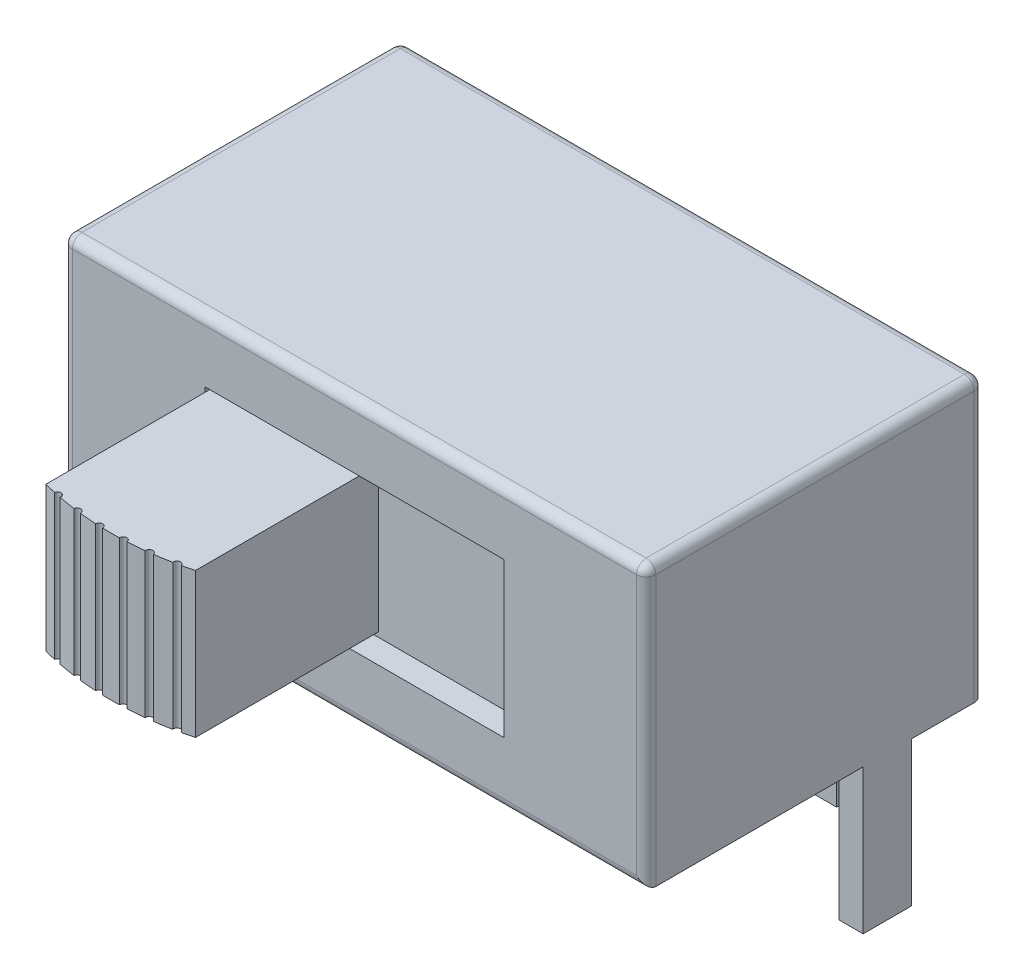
ISO-10303-21;
HEADER;
FILE_DESCRIPTION(('STEP AP214'),'2;1');
FILE_NAME('part.step','',(''),(''),'','','');
FILE_SCHEMA(('AUTOMOTIVE_DESIGN { 1 0 10303 214 1 1 1 1 }'));
ENDSEC;
DATA;
#1=APPLICATION_CONTEXT('core data for automotive mechanical design processes');
#2=APPLICATION_PROTOCOL_DEFINITION('international standard','automotive_design',2000,#1);
#3=PRODUCT_CONTEXT('',#1,'mechanical');
#4=PRODUCT('Part','Part','',(#3));
#5=PRODUCT_RELATED_PRODUCT_CATEGORY('part','',(#4));
#6=PRODUCT_DEFINITION_FORMATION('','',#4);
#7=PRODUCT_DEFINITION_CONTEXT('part definition',#1,'design');
#8=PRODUCT_DEFINITION('design','',#6,#7);
#9=PRODUCT_DEFINITION_SHAPE('','',#8);
#10=(LENGTH_UNIT() NAMED_UNIT(*) SI_UNIT(.MILLI.,.METRE.));
#11=(NAMED_UNIT(*) PLANE_ANGLE_UNIT() SI_UNIT($,.RADIAN.));
#12=(NAMED_UNIT(*) SI_UNIT($,.STERADIAN.) SOLID_ANGLE_UNIT());
#13=UNCERTAINTY_MEASURE_WITH_UNIT(LENGTH_MEASURE(1.E-05),#10,'distance_accuracy_value','');
#14=(GEOMETRIC_REPRESENTATION_CONTEXT(3) GLOBAL_UNCERTAINTY_ASSIGNED_CONTEXT((#13)) GLOBAL_UNIT_ASSIGNED_CONTEXT((#10,
#11,#12)) REPRESENTATION_CONTEXT('',''));
#15=CARTESIAN_POINT('',(0.,0.,0.));
#16=DIRECTION('',(0.,0.,1.));
#17=DIRECTION('',(1.,0.,0.));
#18=AXIS2_PLACEMENT_3D('',#15,#16,#17);
#19=CARTESIAN_POINT('',(-3.1,1.3,-0.5));
#20=DIRECTION('',(-1.,0.,0.));
#21=DIRECTION('',(0.,0.,1.));
#22=AXIS2_PLACEMENT_3D('',#19,#20,#21);
#23=PLANE('',#22);
#24=DIRECTION('',(0.,0.,1.));
#25=VECTOR('',#24,1.);
#26=CARTESIAN_POINT('',(-3.1,1.4,-0.5));
#27=LINE('',#26,#25);
#28=CARTESIAN_POINT('',(-3.1,1.4,-0.5));
#29=VERTEX_POINT('',#28);
#30=CARTESIAN_POINT('',(-3.1,1.4,0.));
#31=VERTEX_POINT('',#30);
#32=EDGE_CURVE('E691',#29,#31,#27,.T.);
#33=ORIENTED_EDGE('',*,*,#32,.T.);
#34=DIRECTION('',(0.,-1.,0.));
#35=VECTOR('',#34,1.);
#36=CARTESIAN_POINT('',(-3.1,1.3,0.));
#37=LINE('',#36,#35);
#38=CARTESIAN_POINT('',(-3.1,1.3,0.));
#39=VERTEX_POINT('',#38);
#40=EDGE_CURVE('E384',#31,#39,#37,.T.);
#41=ORIENTED_EDGE('',*,*,#40,.T.);
#42=DIRECTION('',(0.,0.,1.));
#43=VECTOR('',#42,1.);
#44=CARTESIAN_POINT('',(-3.1,1.3,-0.5));
#45=LINE('',#44,#43);
#46=CARTESIAN_POINT('',(-3.1,1.3,-0.5));
#47=VERTEX_POINT('',#46);
#48=EDGE_CURVE('E403',#47,#39,#45,.T.);
#49=ORIENTED_EDGE('',*,*,#48,.F.);
#50=DIRECTION('',(0.,-1.,0.));
#51=VECTOR('',#50,1.);
#52=CARTESIAN_POINT('',(-3.1,1.3,-0.5));
#53=LINE('',#52,#51);
#54=EDGE_CURVE('E394',#29,#47,#53,.T.);
#55=ORIENTED_EDGE('',*,*,#54,.F.);
#56=EDGE_LOOP('',(#33,#41,#49,#55));
#57=FACE_BOUND('',#56,.T.);
#58=ADVANCED_FACE('F33',(#57),#23,.F.);
#59=CARTESIAN_POINT('',(-6.05,0.,-7.));
#60=DIRECTION('',(0.,-1.,0.));
#61=DIRECTION('',(0.,0.,-1.));
#62=AXIS2_PLACEMENT_3D('',#59,#60,#61);
#63=PLANE('',#62);
#64=DIRECTION('',(0.,0.,-1.));
#65=VECTOR('',#64,1.);
#66=CARTESIAN_POINT('',(6.05,0.,0.));
#67=LINE('',#66,#65);
#68=CARTESIAN_POINT('',(6.05,0.,-0.2));
#69=VERTEX_POINT('',#68);
#70=CARTESIAN_POINT('',(6.05,0.,-4.5));
#71=VERTEX_POINT('',#70);
#72=EDGE_CURVE('E602',#69,#71,#67,.T.);
#73=ORIENTED_EDGE('',*,*,#72,.F.);
#74=DIRECTION('',(1.,0.,0.));
#75=VECTOR('',#74,1.);
#76=CARTESIAN_POINT('',(-6.05,0.,-0.2));
#77=LINE('',#76,#75);
#78=CARTESIAN_POINT('',(-6.05,0.,-0.2));
#79=VERTEX_POINT('',#78);
#80=EDGE_CURVE('E11',#69,#79,#77,.F.);
#81=ORIENTED_EDGE('',*,*,#80,.T.);
#82=DIRECTION('',(0.,0.,1.));
#83=VECTOR('',#82,1.);
#84=CARTESIAN_POINT('',(-6.05,0.,0.));
#85=LINE('',#84,#83);
#86=CARTESIAN_POINT('',(-6.05,0.,-4.5));
#87=VERTEX_POINT('',#86);
#88=EDGE_CURVE('E597',#87,#79,#85,.T.);
#89=ORIENTED_EDGE('',*,*,#88,.F.);
#90=DIRECTION('',(-1.,0.,0.));
#91=VECTOR('',#90,1.);
#92=CARTESIAN_POINT('',(-6.05,0.,-4.5));
#93=LINE('',#92,#91);
#94=CARTESIAN_POINT('',(-5.55,0.,-4.5));
#95=VERTEX_POINT('',#94);
#96=EDGE_CURVE('E537',#95,#87,#93,.T.);
#97=ORIENTED_EDGE('',*,*,#96,.F.);
#98=DIRECTION('',(0.,0.,1.));
#99=VECTOR('',#98,1.);
#100=CARTESIAN_POINT('',(-5.55,0.,-4.5));
#101=LINE('',#100,#99);
#102=CARTESIAN_POINT('',(-5.55,0.,-5.5));
#103=VERTEX_POINT('',#102);
#104=EDGE_CURVE('E544',#103,#95,#101,.T.);
#105=ORIENTED_EDGE('',*,*,#104,.F.);
#106=DIRECTION('',(1.,0.,0.));
#107=VECTOR('',#106,1.);
#108=CARTESIAN_POINT('',(-6.05,0.,-5.5));
#109=LINE('',#108,#107);
#110=CARTESIAN_POINT('',(-6.05,0.,-5.5));
#111=VERTEX_POINT('',#110);
#112=EDGE_CURVE('E532',#111,#103,#109,.T.);
#113=ORIENTED_EDGE('',*,*,#112,.F.);
#114=CARTESIAN_POINT('',(-6.05,0.,-6.8));
#115=VERTEX_POINT('',#114);
#116=EDGE_CURVE('E593',#115,#111,#85,.T.);
#117=ORIENTED_EDGE('',*,*,#116,.F.);
#118=CARTESIAN_POINT('',(-5.85,0.,-6.8));
#119=DIRECTION('',(0.,-1.,0.));
#120=DIRECTION('',(0.,0.,-1.));
#121=AXIS2_PLACEMENT_3D('',#118,#119,#120);
#122=CIRCLE('',#121,0.2);
#123=CARTESIAN_POINT('',(-5.85,0.,-7.));
#124=VERTEX_POINT('',#123);
#125=EDGE_CURVE('E42',#115,#124,#122,.T.);
#126=ORIENTED_EDGE('',*,*,#125,.T.);
#127=DIRECTION('',(-1.,0.,0.));
#128=VECTOR('',#127,1.);
#129=CARTESIAN_POINT('',(-6.05,0.,-7.));
#130=LINE('',#129,#128);
#131=CARTESIAN_POINT('',(-3.5,0.,-7.));
#132=VERTEX_POINT('',#131);
#133=EDGE_CURVE('E998',#132,#124,#130,.T.);
#134=ORIENTED_EDGE('',*,*,#133,.F.);
#135=DIRECTION('',(0.,0.,-1.));
#136=VECTOR('',#135,1.);
#137=CARTESIAN_POINT('',(-3.5,0.,-7.));
#138=LINE('',#137,#136);
#139=CARTESIAN_POINT('',(-3.5,0.,-6.5));
#140=VERTEX_POINT('',#139);
#141=EDGE_CURVE('E505',#140,#132,#138,.T.);
#142=ORIENTED_EDGE('',*,*,#141,.F.);
#143=DIRECTION('',(-1.,0.,0.));
#144=VECTOR('',#143,1.);
#145=CARTESIAN_POINT('',(-3.5,0.,-6.5));
#146=LINE('',#145,#144);
#147=CARTESIAN_POINT('',(-2.5,0.,-6.5));
#148=VERTEX_POINT('',#147);
#149=EDGE_CURVE('E510',#148,#140,#146,.T.);
#150=ORIENTED_EDGE('',*,*,#149,.F.);
#151=DIRECTION('',(0.,0.,1.));
#152=VECTOR('',#151,1.);
#153=CARTESIAN_POINT('',(-2.5,0.,-7.));
#154=LINE('',#153,#152);
#155=CARTESIAN_POINT('',(-2.5,0.,-7.));
#156=VERTEX_POINT('',#155);
#157=EDGE_CURVE('E519',#156,#148,#154,.T.);
#158=ORIENTED_EDGE('',*,*,#157,.F.);
#159=CARTESIAN_POINT('',(-0.5,0.,-7.));
#160=VERTEX_POINT('',#159);
#161=EDGE_CURVE('E1001',#160,#156,#130,.T.);
#162=ORIENTED_EDGE('',*,*,#161,.F.);
#163=DIRECTION('',(0.,0.,-1.));
#164=VECTOR('',#163,1.);
#165=CARTESIAN_POINT('',(-0.5,0.,-7.));
#166=LINE('',#165,#164);
#167=CARTESIAN_POINT('',(-0.5,0.,-6.5));
#168=VERTEX_POINT('',#167);
#169=EDGE_CURVE('E478',#168,#160,#166,.T.);
#170=ORIENTED_EDGE('',*,*,#169,.F.);
#171=DIRECTION('',(-1.,0.,0.));
#172=VECTOR('',#171,1.);
#173=CARTESIAN_POINT('',(-0.5,0.,-6.5));
#174=LINE('',#173,#172);
#175=CARTESIAN_POINT('',(0.5,0.,-6.5));
#176=VERTEX_POINT('',#175);
#177=EDGE_CURVE('E483',#176,#168,#174,.T.);
#178=ORIENTED_EDGE('',*,*,#177,.F.);
#179=DIRECTION('',(0.,0.,1.));
#180=VECTOR('',#179,1.);
#181=CARTESIAN_POINT('',(0.5,0.,-7.));
#182=LINE('',#181,#180);
#183=CARTESIAN_POINT('',(0.5,0.,-7.));
#184=VERTEX_POINT('',#183);
#185=EDGE_CURVE('E491',#184,#176,#182,.T.);
#186=ORIENTED_EDGE('',*,*,#185,.F.);
#187=CARTESIAN_POINT('',(2.5,0.,-7.));
#188=VERTEX_POINT('',#187);
#189=EDGE_CURVE('E1002',#188,#184,#130,.T.);
#190=ORIENTED_EDGE('',*,*,#189,.F.);
#191=DIRECTION('',(0.,0.,-1.));
#192=VECTOR('',#191,1.);
#193=CARTESIAN_POINT('',(2.5,0.,-7.));
#194=LINE('',#193,#192);
#195=CARTESIAN_POINT('',(2.5,0.,-6.5));
#196=VERTEX_POINT('',#195);
#197=EDGE_CURVE('E451',#196,#188,#194,.T.);
#198=ORIENTED_EDGE('',*,*,#197,.F.);
#199=DIRECTION('',(-1.,0.,0.));
#200=VECTOR('',#199,1.);
#201=CARTESIAN_POINT('',(2.5,0.,-6.5));
#202=LINE('',#201,#200);
#203=CARTESIAN_POINT('',(3.5,0.,-6.5));
#204=VERTEX_POINT('',#203);
#205=EDGE_CURVE('E456',#204,#196,#202,.T.);
#206=ORIENTED_EDGE('',*,*,#205,.F.);
#207=DIRECTION('',(0.,0.,1.));
#208=VECTOR('',#207,1.);
#209=CARTESIAN_POINT('',(3.5,0.,-7.));
#210=LINE('',#209,#208);
#211=CARTESIAN_POINT('',(3.5,0.,-7.));
#212=VERTEX_POINT('',#211);
#213=EDGE_CURVE('E464',#212,#204,#210,.T.);
#214=ORIENTED_EDGE('',*,*,#213,.F.);
#215=CARTESIAN_POINT('',(5.85,0.,-7.));
#216=VERTEX_POINT('',#215);
#217=EDGE_CURVE('E564',#216,#212,#130,.T.);
#218=ORIENTED_EDGE('',*,*,#217,.F.);
#219=CARTESIAN_POINT('',(5.85,0.,-6.8));
#220=DIRECTION('',(0.,-1.,0.));
#221=DIRECTION('',(0.,0.,-1.));
#222=AXIS2_PLACEMENT_3D('',#219,#220,#221);
#223=CIRCLE('',#222,0.2);
#224=CARTESIAN_POINT('',(6.05,0.,-6.8));
#225=VERTEX_POINT('',#224);
#226=EDGE_CURVE('E644',#216,#225,#223,.T.);
#227=ORIENTED_EDGE('',*,*,#226,.T.);
#228=CARTESIAN_POINT('',(6.05,0.,-5.5));
#229=VERTEX_POINT('',#228);
#230=EDGE_CURVE('E596',#229,#225,#67,.T.);
#231=ORIENTED_EDGE('',*,*,#230,.F.);
#232=DIRECTION('',(1.,0.,0.));
#233=VECTOR('',#232,1.);
#234=CARTESIAN_POINT('',(6.05,0.,-5.5));
#235=LINE('',#234,#233);
#236=CARTESIAN_POINT('',(5.55,0.,-5.5));
#237=VERTEX_POINT('',#236);
#238=EDGE_CURVE('E429',#237,#229,#235,.T.);
#239=ORIENTED_EDGE('',*,*,#238,.F.);
#240=DIRECTION('',(0.,0.,-1.));
#241=VECTOR('',#240,1.);
#242=CARTESIAN_POINT('',(5.55,0.,-4.5));
#243=LINE('',#242,#241);
#244=CARTESIAN_POINT('',(5.55,0.,-4.5));
#245=VERTEX_POINT('',#244);
#246=EDGE_CURVE('E438',#245,#237,#243,.T.);
#247=ORIENTED_EDGE('',*,*,#246,.F.);
#248=DIRECTION('',(-1.,0.,0.));
#249=VECTOR('',#248,1.);
#250=CARTESIAN_POINT('',(6.05,0.,-4.5));
#251=LINE('',#250,#249);
#252=EDGE_CURVE('E418',#71,#245,#251,.T.);
#253=ORIENTED_EDGE('',*,*,#252,.F.);
#254=EDGE_LOOP('',(#73,#81,#89,#97,#105,#113,#117,#126,#134,#142,#150,#158,#162,#170,#178,#186,
#190,#198,#206,#214,#218,#227,#231,#239,#247,#253));
#255=FACE_BOUND('',#254,.T.);
#256=ADVANCED_FACE('F628',(#255),#63,.T.);
#257=CARTESIAN_POINT('',(-6.05,5.8,0.));
#258=DIRECTION('',(1.,0.,0.));
#259=DIRECTION('',(0.,0.,-1.));
#260=AXIS2_PLACEMENT_3D('',#257,#258,#259);
#261=PLANE('',#260);
#262=DIRECTION('',(0.,0.,1.));
#263=VECTOR('',#262,1.);
#264=CARTESIAN_POINT('',(-6.05,5.6,0.));
#265=LINE('',#264,#263);
#266=CARTESIAN_POINT('',(-6.05,5.6,-0.2));
#267=VERTEX_POINT('',#266);
#268=CARTESIAN_POINT('',(-6.05,5.6,-6.8));
#269=VERTEX_POINT('',#268);
#270=EDGE_CURVE('E50',#267,#269,#265,.F.);
#271=ORIENTED_EDGE('',*,*,#270,.T.);
#272=DIRECTION('',(0.,-1.,0.));
#273=VECTOR('',#272,1.);
#274=CARTESIAN_POINT('',(-6.05,5.8,-6.8));
#275=LINE('',#274,#273);
#276=EDGE_CURVE('E635',#269,#115,#275,.T.);
#277=ORIENTED_EDGE('',*,*,#276,.T.);
#278=ORIENTED_EDGE('',*,*,#116,.T.);
#279=DIRECTION('',(0.,1.,0.));
#280=VECTOR('',#279,1.);
#281=CARTESIAN_POINT('',(-6.05,-3.,-5.5));
#282=LINE('',#281,#280);
#283=CARTESIAN_POINT('',(-6.05,-3.,-5.5));
#284=VERTEX_POINT('',#283);
#285=EDGE_CURVE('E607',#284,#111,#282,.T.);
#286=ORIENTED_EDGE('',*,*,#285,.F.);
#287=DIRECTION('',(0.,0.,-1.));
#288=VECTOR('',#287,1.);
#289=CARTESIAN_POINT('',(-6.05,-3.,-4.5));
#290=LINE('',#289,#288);
#291=CARTESIAN_POINT('',(-6.05,-3.,-4.5));
#292=VERTEX_POINT('',#291);
#293=EDGE_CURVE('E533',#292,#284,#290,.T.);
#294=ORIENTED_EDGE('',*,*,#293,.F.);
#295=DIRECTION('',(0.,1.,0.));
#296=VECTOR('',#295,1.);
#297=CARTESIAN_POINT('',(-6.05,-3.,-4.5));
#298=LINE('',#297,#296);
#299=EDGE_CURVE('E543',#292,#87,#298,.T.);
#300=ORIENTED_EDGE('',*,*,#299,.T.);
#301=ORIENTED_EDGE('',*,*,#88,.T.);
#302=DIRECTION('',(0.,-1.,0.));
#303=VECTOR('',#302,1.);
#304=CARTESIAN_POINT('',(-6.05,5.8,-0.2));
#305=LINE('',#304,#303);
#306=EDGE_CURVE('E55',#79,#267,#305,.F.);
#307=ORIENTED_EDGE('',*,*,#306,.T.);
#308=EDGE_LOOP('',(#271,#277,#278,#286,#294,#300,#301,#307));
#309=FACE_BOUND('',#308,.T.);
#310=ADVANCED_FACE('F634',(#309),#261,.F.);
#311=CARTESIAN_POINT('',(-6.05,5.8,0.));
#312=DIRECTION('',(0.,0.,-1.));
#313=DIRECTION('',(-1.,0.,0.));
#314=AXIS2_PLACEMENT_3D('',#311,#312,#313);
#315=PLANE('',#314);
#316=DIRECTION('',(1.,0.,0.));
#317=VECTOR('',#316,1.);
#318=CARTESIAN_POINT('',(-6.05,5.6,0.));
#319=LINE('',#318,#317);
#320=CARTESIAN_POINT('',(5.85,5.6,0.));
#321=VERTEX_POINT('',#320);
#322=CARTESIAN_POINT('',(-5.85,5.6,0.));
#323=VERTEX_POINT('',#322);
#324=EDGE_CURVE('E588',#321,#323,#319,.F.);
#325=ORIENTED_EDGE('',*,*,#324,.T.);
#326=DIRECTION('',(0.,-1.,0.));
#327=VECTOR('',#326,1.);
#328=CARTESIAN_POINT('',(-5.85,5.8,0.));
#329=LINE('',#328,#327);
#330=CARTESIAN_POINT('',(-5.85,0.2,0.));
#331=VERTEX_POINT('',#330);
#332=EDGE_CURVE('E591',#323,#331,#329,.T.);
#333=ORIENTED_EDGE('',*,*,#332,.T.);
#334=DIRECTION('',(1.,0.,0.));
#335=VECTOR('',#334,1.);
#336=CARTESIAN_POINT('',(6.05,0.2,0.));
#337=LINE('',#336,#335);
#338=CARTESIAN_POINT('',(5.85,0.2,0.));
#339=VERTEX_POINT('',#338);
#340=EDGE_CURVE('E586',#331,#339,#337,.T.);
#341=ORIENTED_EDGE('',*,*,#340,.T.);
#342=DIRECTION('',(0.,-1.,0.));
#343=VECTOR('',#342,1.);
#344=CARTESIAN_POINT('',(5.85,5.8,0.));
#345=LINE('',#344,#343);
#346=EDGE_CURVE('E584',#339,#321,#345,.F.);
#347=ORIENTED_EDGE('',*,*,#346,.T.);
#348=EDGE_LOOP('',(#325,#333,#341,#347));
#349=FACE_BOUND('',#348,.T.);
#350=DIRECTION('',(1.,0.,0.));
#351=VECTOR('',#350,1.);
#352=CARTESIAN_POINT('',(-3.1,1.3,0.));
#353=LINE('',#352,#351);
#354=CARTESIAN_POINT('',(3.1,1.3,0.));
#355=VERTEX_POINT('',#354);
#356=EDGE_CURVE('E407',#39,#355,#353,.T.);
#357=ORIENTED_EDGE('',*,*,#356,.F.);
#358=ORIENTED_EDGE('',*,*,#40,.F.);
#359=DIRECTION('',(0.,-1.,0.));
#360=VECTOR('',#359,1.);
#361=CARTESIAN_POINT('',(-3.1,5.8,0.));
#362=LINE('',#361,#360);
#363=CARTESIAN_POINT('',(-3.1,4.4,0.));
#364=VERTEX_POINT('',#363);
#365=EDGE_CURVE('E382',#364,#31,#362,.T.);
#366=ORIENTED_EDGE('',*,*,#365,.F.);
#367=CARTESIAN_POINT('',(-3.1,4.5,0.));
#368=VERTEX_POINT('',#367);
#369=EDGE_CURVE('E404',#368,#364,#37,.T.);
#370=ORIENTED_EDGE('',*,*,#369,.F.);
#371=DIRECTION('',(-1.,0.,0.));
#372=VECTOR('',#371,1.);
#373=CARTESIAN_POINT('',(-3.1,4.5,0.));
#374=LINE('',#373,#372);
#375=CARTESIAN_POINT('',(3.1,4.5,0.));
#376=VERTEX_POINT('',#375);
#377=EDGE_CURVE('E413',#376,#368,#374,.T.);
#378=ORIENTED_EDGE('',*,*,#377,.F.);
#379=DIRECTION('',(0.,1.,0.));
#380=VECTOR('',#379,1.);
#381=CARTESIAN_POINT('',(3.1,1.3,0.));
#382=LINE('',#381,#380);
#383=EDGE_CURVE('E410',#355,#376,#382,.T.);
#384=ORIENTED_EDGE('',*,*,#383,.F.);
#385=EDGE_LOOP('',(#357,#358,#366,#370,#378,#384));
#386=FACE_BOUND('',#385,.T.);
#387=ADVANCED_FACE('F930',(#349,#386),#315,.F.);
#388=CARTESIAN_POINT('',(6.05,5.8,0.));
#389=DIRECTION('',(-1.,0.,0.));
#390=DIRECTION('',(0.,0.,1.));
#391=AXIS2_PLACEMENT_3D('',#388,#389,#390);
#392=PLANE('',#391);
#393=ORIENTED_EDGE('',*,*,#230,.T.);
#394=DIRECTION('',(0.,-1.,0.));
#395=VECTOR('',#394,1.);
#396=CARTESIAN_POINT('',(6.05,5.8,-6.8));
#397=LINE('',#396,#395);
#398=CARTESIAN_POINT('',(6.05,5.6,-6.8));
#399=VERTEX_POINT('',#398);
#400=EDGE_CURVE('E582',#225,#399,#397,.F.);
#401=ORIENTED_EDGE('',*,*,#400,.T.);
#402=DIRECTION('',(0.,0.,-1.));
#403=VECTOR('',#402,1.);
#404=CARTESIAN_POINT('',(6.05,5.6,0.));
#405=LINE('',#404,#403);
#406=CARTESIAN_POINT('',(6.05,5.6,-0.2));
#407=VERTEX_POINT('',#406);
#408=EDGE_CURVE('E580',#399,#407,#405,.F.);
#409=ORIENTED_EDGE('',*,*,#408,.T.);
#410=DIRECTION('',(0.,-1.,0.));
#411=VECTOR('',#410,1.);
#412=CARTESIAN_POINT('',(6.05,5.8,-0.2));
#413=LINE('',#412,#411);
#414=EDGE_CURVE('E578',#407,#69,#413,.T.);
#415=ORIENTED_EDGE('',*,*,#414,.T.);
#416=ORIENTED_EDGE('',*,*,#72,.T.);
#417=DIRECTION('',(0.,1.,0.));
#418=VECTOR('',#417,1.);
#419=CARTESIAN_POINT('',(6.05,-3.,-4.5));
#420=LINE('',#419,#418);
#421=CARTESIAN_POINT('',(6.05,-3.,-4.5));
#422=VERTEX_POINT('',#421);
#423=EDGE_CURVE('E435',#422,#71,#420,.T.);
#424=ORIENTED_EDGE('',*,*,#423,.F.);
#425=DIRECTION('',(0.,0.,1.));
#426=VECTOR('',#425,1.);
#427=CARTESIAN_POINT('',(6.05,-3.,-4.5));
#428=LINE('',#427,#426);
#429=CARTESIAN_POINT('',(6.05,-3.,-5.5));
#430=VERTEX_POINT('',#429);
#431=EDGE_CURVE('E433',#430,#422,#428,.T.);
#432=ORIENTED_EDGE('',*,*,#431,.F.);
#433=DIRECTION('',(0.,1.,0.));
#434=VECTOR('',#433,1.);
#435=CARTESIAN_POINT('',(6.05,-3.,-5.5));
#436=LINE('',#435,#434);
#437=EDGE_CURVE('E444',#430,#229,#436,.T.);
#438=ORIENTED_EDGE('',*,*,#437,.T.);
#439=EDGE_LOOP('',(#393,#401,#409,#415,#416,#424,#432,#438));
#440=FACE_BOUND('',#439,.T.);
#441=ADVANCED_FACE('F926',(#440),#392,.F.);
#442=CARTESIAN_POINT('',(-6.05,5.8,-7.));
#443=DIRECTION('',(0.,0.,1.));
#444=DIRECTION('',(1.,0.,0.));
#445=AXIS2_PLACEMENT_3D('',#442,#443,#444);
#446=PLANE('',#445);
#447=ORIENTED_EDGE('',*,*,#133,.T.);
#448=DIRECTION('',(0.,-1.,0.));
#449=VECTOR('',#448,1.);
#450=CARTESIAN_POINT('',(-5.85,5.8,-7.));
#451=LINE('',#450,#449);
#452=CARTESIAN_POINT('',(-5.85,5.6,-7.));
#453=VERTEX_POINT('',#452);
#454=EDGE_CURVE('E576',#124,#453,#451,.F.);
#455=ORIENTED_EDGE('',*,*,#454,.T.);
#456=DIRECTION('',(-1.,0.,0.));
#457=VECTOR('',#456,1.);
#458=CARTESIAN_POINT('',(-6.05,5.6,-7.));
#459=LINE('',#458,#457);
#460=CARTESIAN_POINT('',(5.85,5.6,-7.));
#461=VERTEX_POINT('',#460);
#462=EDGE_CURVE('E573',#453,#461,#459,.F.);
#463=ORIENTED_EDGE('',*,*,#462,.T.);
#464=DIRECTION('',(0.,-1.,0.));
#465=VECTOR('',#464,1.);
#466=CARTESIAN_POINT('',(5.85,5.8,-7.));
#467=LINE('',#466,#465);
#468=EDGE_CURVE('E571',#461,#216,#467,.T.);
#469=ORIENTED_EDGE('',*,*,#468,.T.);
#470=ORIENTED_EDGE('',*,*,#217,.T.);
#471=DIRECTION('',(0.,1.,0.));
#472=VECTOR('',#471,1.);
#473=CARTESIAN_POINT('',(3.5,-3.,-7.));
#474=LINE('',#473,#472);
#475=CARTESIAN_POINT('',(3.5,-3.,-7.));
#476=VERTEX_POINT('',#475);
#477=EDGE_CURVE('E472',#476,#212,#474,.T.);
#478=ORIENTED_EDGE('',*,*,#477,.F.);
#479=DIRECTION('',(1.,0.,0.));
#480=VECTOR('',#479,1.);
#481=CARTESIAN_POINT('',(2.5,-3.,-7.));
#482=LINE('',#481,#480);
#483=CARTESIAN_POINT('',(2.5,-3.,-7.));
#484=VERTEX_POINT('',#483);
#485=EDGE_CURVE('E455',#484,#476,#482,.T.);
#486=ORIENTED_EDGE('',*,*,#485,.F.);
#487=DIRECTION('',(0.,1.,0.));
#488=VECTOR('',#487,1.);
#489=CARTESIAN_POINT('',(2.5,-3.,-7.));
#490=LINE('',#489,#488);
#491=EDGE_CURVE('E475',#484,#188,#490,.T.);
#492=ORIENTED_EDGE('',*,*,#491,.T.);
#493=ORIENTED_EDGE('',*,*,#189,.T.);
#494=DIRECTION('',(0.,1.,0.));
#495=VECTOR('',#494,1.);
#496=CARTESIAN_POINT('',(0.5,-3.,-7.));
#497=LINE('',#496,#495);
#498=CARTESIAN_POINT('',(0.5,-3.,-7.));
#499=VERTEX_POINT('',#498);
#500=EDGE_CURVE('E499',#499,#184,#497,.T.);
#501=ORIENTED_EDGE('',*,*,#500,.F.);
#502=DIRECTION('',(1.,0.,0.));
#503=VECTOR('',#502,1.);
#504=CARTESIAN_POINT('',(-0.5,-3.,-7.));
#505=LINE('',#504,#503);
#506=CARTESIAN_POINT('',(-0.5,-3.,-7.));
#507=VERTEX_POINT('',#506);
#508=EDGE_CURVE('E482',#507,#499,#505,.T.);
#509=ORIENTED_EDGE('',*,*,#508,.F.);
#510=DIRECTION('',(0.,1.,0.));
#511=VECTOR('',#510,1.);
#512=CARTESIAN_POINT('',(-0.5,-3.,-7.));
#513=LINE('',#512,#511);
#514=EDGE_CURVE('E502',#507,#160,#513,.T.);
#515=ORIENTED_EDGE('',*,*,#514,.T.);
#516=ORIENTED_EDGE('',*,*,#161,.T.);
#517=DIRECTION('',(0.,1.,0.));
#518=VECTOR('',#517,1.);
#519=CARTESIAN_POINT('',(-2.5,-3.,-7.));
#520=LINE('',#519,#518);
#521=CARTESIAN_POINT('',(-2.5,-3.,-7.));
#522=VERTEX_POINT('',#521);
#523=EDGE_CURVE('E527',#522,#156,#520,.T.);
#524=ORIENTED_EDGE('',*,*,#523,.F.);
#525=DIRECTION('',(1.,0.,0.));
#526=VECTOR('',#525,1.);
#527=CARTESIAN_POINT('',(-3.5,-3.,-7.));
#528=LINE('',#527,#526);
#529=CARTESIAN_POINT('',(-3.5,-3.,-7.));
#530=VERTEX_POINT('',#529);
#531=EDGE_CURVE('E509',#530,#522,#528,.T.);
#532=ORIENTED_EDGE('',*,*,#531,.F.);
#533=DIRECTION('',(0.,1.,0.));
#534=VECTOR('',#533,1.);
#535=CARTESIAN_POINT('',(-3.5,-3.,-7.));
#536=LINE('',#535,#534);
#537=EDGE_CURVE('E530',#530,#132,#536,.T.);
#538=ORIENTED_EDGE('',*,*,#537,.T.);
#539=EDGE_LOOP('',(#447,#455,#463,#469,#470,#478,#486,#492,#493,#501,#509,#515,#516,#524,#532,#538));
#540=FACE_BOUND('',#539,.T.);
#541=ADVANCED_FACE('F921',(#540),#446,.F.);
#542=CARTESIAN_POINT('',(-6.05,5.8,-7.));
#543=DIRECTION('',(0.,-1.,0.));
#544=DIRECTION('',(0.,0.,-1.));
#545=AXIS2_PLACEMENT_3D('',#542,#543,#544);
#546=PLANE('',#545);
#547=DIRECTION('',(0.,0.,-1.));
#548=VECTOR('',#547,1.);
#549=CARTESIAN_POINT('',(5.85,5.8,-7.));
#550=LINE('',#549,#548);
#551=CARTESIAN_POINT('',(5.85,5.8,-0.2));
#552=VERTEX_POINT('',#551);
#553=CARTESIAN_POINT('',(5.85,5.8,-6.8));
#554=VERTEX_POINT('',#553);
#555=EDGE_CURVE('E566',#552,#554,#550,.T.);
#556=ORIENTED_EDGE('',*,*,#555,.T.);
#557=DIRECTION('',(-1.,0.,0.));
#558=VECTOR('',#557,1.);
#559=CARTESIAN_POINT('',(-6.05,5.8,-6.8));
#560=LINE('',#559,#558);
#561=CARTESIAN_POINT('',(-5.85,5.8,-6.8));
#562=VERTEX_POINT('',#561);
#563=EDGE_CURVE('E568',#554,#562,#560,.T.);
#564=ORIENTED_EDGE('',*,*,#563,.T.);
#565=DIRECTION('',(0.,0.,1.));
#566=VECTOR('',#565,1.);
#567=CARTESIAN_POINT('',(-5.85,5.8,-7.));
#568=LINE('',#567,#566);
#569=CARTESIAN_POINT('',(-5.85,5.8,-0.2));
#570=VERTEX_POINT('',#569);
#571=EDGE_CURVE('E561',#562,#570,#568,.T.);
#572=ORIENTED_EDGE('',*,*,#571,.T.);
#573=DIRECTION('',(1.,0.,0.));
#574=VECTOR('',#573,1.);
#575=CARTESIAN_POINT('',(-6.05,5.8,-0.2));
#576=LINE('',#575,#574);
#577=EDGE_CURVE('E563',#570,#552,#576,.T.);
#578=ORIENTED_EDGE('',*,*,#577,.T.);
#579=EDGE_LOOP('',(#556,#564,#572,#578));
#580=FACE_BOUND('',#579,.T.);
#581=ADVANCED_FACE('F919',(#580),#546,.F.);
#582=CARTESIAN_POINT('',(-6.05,-3.,-5.5));
#583=DIRECTION('',(0.,0.,1.));
#584=DIRECTION('',(1.,0.,0.));
#585=AXIS2_PLACEMENT_3D('',#582,#583,#584);
#586=PLANE('',#585);
#587=ORIENTED_EDGE('',*,*,#112,.T.);
#588=DIRECTION('',(0.,1.,0.));
#589=VECTOR('',#588,1.);
#590=CARTESIAN_POINT('',(-5.55,-3.,-5.5));
#591=LINE('',#590,#589);
#592=CARTESIAN_POINT('',(-5.55,-3.,-5.5));
#593=VERTEX_POINT('',#592);
#594=EDGE_CURVE('E601',#593,#103,#591,.T.);
#595=ORIENTED_EDGE('',*,*,#594,.F.);
#596=DIRECTION('',(1.,0.,0.));
#597=VECTOR('',#596,1.);
#598=CARTESIAN_POINT('',(-6.05,-3.,-5.5));
#599=LINE('',#598,#597);
#600=EDGE_CURVE('E536',#284,#593,#599,.T.);
#601=ORIENTED_EDGE('',*,*,#600,.F.);
#602=ORIENTED_EDGE('',*,*,#285,.T.);
#603=EDGE_LOOP('',(#587,#595,#601,#602));
#604=FACE_BOUND('',#603,.T.);
#605=ADVANCED_FACE('F630',(#604),#586,.F.);
#606=CARTESIAN_POINT('',(-5.55,-3.,-4.5));
#607=DIRECTION('',(-1.,0.,0.));
#608=DIRECTION('',(0.,0.,1.));
#609=AXIS2_PLACEMENT_3D('',#606,#607,#608);
#610=PLANE('',#609);
#611=ORIENTED_EDGE('',*,*,#104,.T.);
#612=DIRECTION('',(0.,1.,0.));
#613=VECTOR('',#612,1.);
#614=CARTESIAN_POINT('',(-5.55,-3.,-4.5));
#615=LINE('',#614,#613);
#616=CARTESIAN_POINT('',(-5.55,-3.,-4.5));
#617=VERTEX_POINT('',#616);
#618=EDGE_CURVE('E549',#617,#95,#615,.T.);
#619=ORIENTED_EDGE('',*,*,#618,.F.);
#620=DIRECTION('',(0.,0.,1.));
#621=VECTOR('',#620,1.);
#622=CARTESIAN_POINT('',(-5.55,-3.,-4.5));
#623=LINE('',#622,#621);
#624=EDGE_CURVE('E539',#593,#617,#623,.T.);
#625=ORIENTED_EDGE('',*,*,#624,.F.);
#626=ORIENTED_EDGE('',*,*,#594,.T.);
#627=EDGE_LOOP('',(#611,#619,#625,#626));
#628=FACE_BOUND('',#627,.T.);
#629=ADVANCED_FACE('F624',(#628),#610,.F.);
#630=CARTESIAN_POINT('',(-6.05,-3.,-4.5));
#631=DIRECTION('',(0.,0.,-1.));
#632=DIRECTION('',(-1.,0.,0.));
#633=AXIS2_PLACEMENT_3D('',#630,#631,#632);
#634=PLANE('',#633);
#635=ORIENTED_EDGE('',*,*,#96,.T.);
#636=ORIENTED_EDGE('',*,*,#299,.F.);
#637=DIRECTION('',(-1.,0.,0.));
#638=VECTOR('',#637,1.);
#639=CARTESIAN_POINT('',(-6.05,-3.,-4.5));
#640=LINE('',#639,#638);
#641=EDGE_CURVE('E541',#617,#292,#640,.T.);
#642=ORIENTED_EDGE('',*,*,#641,.F.);
#643=ORIENTED_EDGE('',*,*,#618,.T.);
#644=EDGE_LOOP('',(#635,#636,#642,#643));
#645=FACE_BOUND('',#644,.T.);
#646=ADVANCED_FACE('F622',(#645),#634,.F.);
#647=CARTESIAN_POINT('',(-6.05,-3.,-5.5));
#648=DIRECTION('',(0.,-1.,0.));
#649=DIRECTION('',(0.,0.,-1.));
#650=AXIS2_PLACEMENT_3D('',#647,#648,#649);
#651=PLANE('',#650);
#652=ORIENTED_EDGE('',*,*,#293,.T.);
#653=ORIENTED_EDGE('',*,*,#600,.T.);
#654=ORIENTED_EDGE('',*,*,#624,.T.);
#655=ORIENTED_EDGE('',*,*,#641,.T.);
#656=EDGE_LOOP('',(#652,#653,#654,#655));
#657=FACE_BOUND('',#656,.T.);
#658=ADVANCED_FACE('F633',(#657),#651,.T.);
#659=CARTESIAN_POINT('',(-3.5,-3.,-7.));
#660=DIRECTION('',(1.,0.,0.));
#661=DIRECTION('',(0.,0.,-1.));
#662=AXIS2_PLACEMENT_3D('',#659,#660,#661);
#663=PLANE('',#662);
#664=ORIENTED_EDGE('',*,*,#141,.T.);
#665=ORIENTED_EDGE('',*,*,#537,.F.);
#666=DIRECTION('',(0.,0.,-1.));
#667=VECTOR('',#666,1.);
#668=CARTESIAN_POINT('',(-3.5,-3.,-7.));
#669=LINE('',#668,#667);
#670=CARTESIAN_POINT('',(-3.5,-3.,-6.5));
#671=VERTEX_POINT('',#670);
#672=EDGE_CURVE('E506',#671,#530,#669,.T.);
#673=ORIENTED_EDGE('',*,*,#672,.F.);
#674=DIRECTION('',(0.,1.,0.));
#675=VECTOR('',#674,1.);
#676=CARTESIAN_POINT('',(-3.5,-3.,-6.5));
#677=LINE('',#676,#675);
#678=EDGE_CURVE('E516',#671,#140,#677,.T.);
#679=ORIENTED_EDGE('',*,*,#678,.T.);
#680=EDGE_LOOP('',(#664,#665,#673,#679));
#681=FACE_BOUND('',#680,.T.);
#682=ADVANCED_FACE('F906',(#681),#663,.F.);
#683=CARTESIAN_POINT('',(-2.5,-3.,-7.));
#684=DIRECTION('',(-1.,0.,0.));
#685=DIRECTION('',(0.,0.,1.));
#686=AXIS2_PLACEMENT_3D('',#683,#684,#685);
#687=PLANE('',#686);
#688=ORIENTED_EDGE('',*,*,#157,.T.);
#689=DIRECTION('',(0.,1.,0.));
#690=VECTOR('',#689,1.);
#691=CARTESIAN_POINT('',(-2.5,-3.,-6.5));
#692=LINE('',#691,#690);
#693=CARTESIAN_POINT('',(-2.5,-3.,-6.5));
#694=VERTEX_POINT('',#693);
#695=EDGE_CURVE('E525',#694,#148,#692,.T.);
#696=ORIENTED_EDGE('',*,*,#695,.F.);
#697=DIRECTION('',(0.,0.,1.));
#698=VECTOR('',#697,1.);
#699=CARTESIAN_POINT('',(-2.5,-3.,-7.));
#700=LINE('',#699,#698);
#701=EDGE_CURVE('E512',#522,#694,#700,.T.);
#702=ORIENTED_EDGE('',*,*,#701,.F.);
#703=ORIENTED_EDGE('',*,*,#523,.T.);
#704=EDGE_LOOP('',(#688,#696,#702,#703));
#705=FACE_BOUND('',#704,.T.);
#706=ADVANCED_FACE('F902',(#705),#687,.F.);
#707=CARTESIAN_POINT('',(-3.5,-3.,-6.5));
#708=DIRECTION('',(0.,0.,-1.));
#709=DIRECTION('',(-1.,0.,0.));
#710=AXIS2_PLACEMENT_3D('',#707,#708,#709);
#711=PLANE('',#710);
#712=ORIENTED_EDGE('',*,*,#149,.T.);
#713=ORIENTED_EDGE('',*,*,#678,.F.);
#714=DIRECTION('',(-1.,0.,0.));
#715=VECTOR('',#714,1.);
#716=CARTESIAN_POINT('',(-3.5,-3.,-6.5));
#717=LINE('',#716,#715);
#718=EDGE_CURVE('E514',#694,#671,#717,.T.);
#719=ORIENTED_EDGE('',*,*,#718,.F.);
#720=ORIENTED_EDGE('',*,*,#695,.T.);
#721=EDGE_LOOP('',(#712,#713,#719,#720));
#722=FACE_BOUND('',#721,.T.);
#723=ADVANCED_FACE('F898',(#722),#711,.F.);
#724=CARTESIAN_POINT('',(-3.5,-3.,-6.5));
#725=DIRECTION('',(0.,1.,0.));
#726=DIRECTION('',(0.,0.,1.));
#727=AXIS2_PLACEMENT_3D('',#724,#725,#726);
#728=PLANE('',#727);
#729=ORIENTED_EDGE('',*,*,#672,.T.);
#730=ORIENTED_EDGE('',*,*,#531,.T.);
#731=ORIENTED_EDGE('',*,*,#701,.T.);
#732=ORIENTED_EDGE('',*,*,#718,.T.);
#733=EDGE_LOOP('',(#729,#730,#731,#732));
#734=FACE_BOUND('',#733,.T.);
#735=ADVANCED_FACE('F894',(#734),#728,.F.);
#736=CARTESIAN_POINT('',(-0.5,-3.,-7.));
#737=DIRECTION('',(1.,0.,0.));
#738=DIRECTION('',(0.,0.,-1.));
#739=AXIS2_PLACEMENT_3D('',#736,#737,#738);
#740=PLANE('',#739);
#741=ORIENTED_EDGE('',*,*,#169,.T.);
#742=ORIENTED_EDGE('',*,*,#514,.F.);
#743=DIRECTION('',(0.,0.,-1.));
#744=VECTOR('',#743,1.);
#745=CARTESIAN_POINT('',(-0.5,-3.,-7.));
#746=LINE('',#745,#744);
#747=CARTESIAN_POINT('',(-0.5,-3.,-6.5));
#748=VERTEX_POINT('',#747);
#749=EDGE_CURVE('E479',#748,#507,#746,.T.);
#750=ORIENTED_EDGE('',*,*,#749,.F.);
#751=DIRECTION('',(0.,1.,0.));
#752=VECTOR('',#751,1.);
#753=CARTESIAN_POINT('',(-0.5,-3.,-6.5));
#754=LINE('',#753,#752);
#755=EDGE_CURVE('E489',#748,#168,#754,.T.);
#756=ORIENTED_EDGE('',*,*,#755,.T.);
#757=EDGE_LOOP('',(#741,#742,#750,#756));
#758=FACE_BOUND('',#757,.T.);
#759=ADVANCED_FACE('F890',(#758),#740,.F.);
#760=CARTESIAN_POINT('',(0.5,-3.,-7.));
#761=DIRECTION('',(-1.,0.,0.));
#762=DIRECTION('',(0.,0.,1.));
#763=AXIS2_PLACEMENT_3D('',#760,#761,#762);
#764=PLANE('',#763);
#765=ORIENTED_EDGE('',*,*,#185,.T.);
#766=DIRECTION('',(0.,1.,0.));
#767=VECTOR('',#766,1.);
#768=CARTESIAN_POINT('',(0.5,-3.,-6.5));
#769=LINE('',#768,#767);
#770=CARTESIAN_POINT('',(0.5,-3.,-6.5));
#771=VERTEX_POINT('',#770);
#772=EDGE_CURVE('E496',#771,#176,#769,.T.);
#773=ORIENTED_EDGE('',*,*,#772,.F.);
#774=DIRECTION('',(0.,0.,1.));
#775=VECTOR('',#774,1.);
#776=CARTESIAN_POINT('',(0.5,-3.,-7.));
#777=LINE('',#776,#775);
#778=EDGE_CURVE('E485',#499,#771,#777,.T.);
#779=ORIENTED_EDGE('',*,*,#778,.F.);
#780=ORIENTED_EDGE('',*,*,#500,.T.);
#781=EDGE_LOOP('',(#765,#773,#779,#780));
#782=FACE_BOUND('',#781,.T.);
#783=ADVANCED_FACE('F886',(#782),#764,.F.);
#784=CARTESIAN_POINT('',(-0.5,-3.,-6.5));
#785=DIRECTION('',(0.,0.,-1.));
#786=DIRECTION('',(-1.,0.,0.));
#787=AXIS2_PLACEMENT_3D('',#784,#785,#786);
#788=PLANE('',#787);
#789=ORIENTED_EDGE('',*,*,#177,.T.);
#790=ORIENTED_EDGE('',*,*,#755,.F.);
#791=DIRECTION('',(-1.,0.,0.));
#792=VECTOR('',#791,1.);
#793=CARTESIAN_POINT('',(-0.5,-3.,-6.5));
#794=LINE('',#793,#792);
#795=EDGE_CURVE('E487',#771,#748,#794,.T.);
#796=ORIENTED_EDGE('',*,*,#795,.F.);
#797=ORIENTED_EDGE('',*,*,#772,.T.);
#798=EDGE_LOOP('',(#789,#790,#796,#797));
#799=FACE_BOUND('',#798,.T.);
#800=ADVANCED_FACE('F882',(#799),#788,.F.);
#801=CARTESIAN_POINT('',(-0.5,-3.,-6.5));
#802=DIRECTION('',(0.,1.,0.));
#803=DIRECTION('',(0.,0.,1.));
#804=AXIS2_PLACEMENT_3D('',#801,#802,#803);
#805=PLANE('',#804);
#806=ORIENTED_EDGE('',*,*,#749,.T.);
#807=ORIENTED_EDGE('',*,*,#508,.T.);
#808=ORIENTED_EDGE('',*,*,#778,.T.);
#809=ORIENTED_EDGE('',*,*,#795,.T.);
#810=EDGE_LOOP('',(#806,#807,#808,#809));
#811=FACE_BOUND('',#810,.T.);
#812=ADVANCED_FACE('F878',(#811),#805,.F.);
#813=CARTESIAN_POINT('',(2.5,-3.,-7.));
#814=DIRECTION('',(1.,0.,0.));
#815=DIRECTION('',(0.,0.,-1.));
#816=AXIS2_PLACEMENT_3D('',#813,#814,#815);
#817=PLANE('',#816);
#818=ORIENTED_EDGE('',*,*,#197,.T.);
#819=ORIENTED_EDGE('',*,*,#491,.F.);
#820=DIRECTION('',(0.,0.,-1.));
#821=VECTOR('',#820,1.);
#822=CARTESIAN_POINT('',(2.5,-3.,-7.));
#823=LINE('',#822,#821);
#824=CARTESIAN_POINT('',(2.5,-3.,-6.5));
#825=VERTEX_POINT('',#824);
#826=EDGE_CURVE('E452',#825,#484,#823,.T.);
#827=ORIENTED_EDGE('',*,*,#826,.F.);
#828=DIRECTION('',(0.,1.,0.));
#829=VECTOR('',#828,1.);
#830=CARTESIAN_POINT('',(2.5,-3.,-6.5));
#831=LINE('',#830,#829);
#832=EDGE_CURVE('E462',#825,#196,#831,.T.);
#833=ORIENTED_EDGE('',*,*,#832,.T.);
#834=EDGE_LOOP('',(#818,#819,#827,#833));
#835=FACE_BOUND('',#834,.T.);
#836=ADVANCED_FACE('F874',(#835),#817,.F.);
#837=CARTESIAN_POINT('',(3.5,-3.,-7.));
#838=DIRECTION('',(-1.,0.,0.));
#839=DIRECTION('',(0.,0.,1.));
#840=AXIS2_PLACEMENT_3D('',#837,#838,#839);
#841=PLANE('',#840);
#842=ORIENTED_EDGE('',*,*,#213,.T.);
#843=DIRECTION('',(0.,1.,0.));
#844=VECTOR('',#843,1.);
#845=CARTESIAN_POINT('',(3.5,-3.,-6.5));
#846=LINE('',#845,#844);
#847=CARTESIAN_POINT('',(3.5,-3.,-6.5));
#848=VERTEX_POINT('',#847);
#849=EDGE_CURVE('E469',#848,#204,#846,.T.);
#850=ORIENTED_EDGE('',*,*,#849,.F.);
#851=DIRECTION('',(0.,0.,1.));
#852=VECTOR('',#851,1.);
#853=CARTESIAN_POINT('',(3.5,-3.,-7.));
#854=LINE('',#853,#852);
#855=EDGE_CURVE('E458',#476,#848,#854,.T.);
#856=ORIENTED_EDGE('',*,*,#855,.F.);
#857=ORIENTED_EDGE('',*,*,#477,.T.);
#858=EDGE_LOOP('',(#842,#850,#856,#857));
#859=FACE_BOUND('',#858,.T.);
#860=ADVANCED_FACE('F870',(#859),#841,.F.);
#861=CARTESIAN_POINT('',(2.5,-3.,-6.5));
#862=DIRECTION('',(0.,0.,-1.));
#863=DIRECTION('',(-1.,0.,0.));
#864=AXIS2_PLACEMENT_3D('',#861,#862,#863);
#865=PLANE('',#864);
#866=ORIENTED_EDGE('',*,*,#205,.T.);
#867=ORIENTED_EDGE('',*,*,#832,.F.);
#868=DIRECTION('',(-1.,0.,0.));
#869=VECTOR('',#868,1.);
#870=CARTESIAN_POINT('',(2.5,-3.,-6.5));
#871=LINE('',#870,#869);
#872=EDGE_CURVE('E460',#848,#825,#871,.T.);
#873=ORIENTED_EDGE('',*,*,#872,.F.);
#874=ORIENTED_EDGE('',*,*,#849,.T.);
#875=EDGE_LOOP('',(#866,#867,#873,#874));
#876=FACE_BOUND('',#875,.T.);
#877=ADVANCED_FACE('F866',(#876),#865,.F.);
#878=CARTESIAN_POINT('',(2.5,-3.,-6.5));
#879=DIRECTION('',(0.,1.,0.));
#880=DIRECTION('',(0.,0.,1.));
#881=AXIS2_PLACEMENT_3D('',#878,#879,#880);
#882=PLANE('',#881);
#883=ORIENTED_EDGE('',*,*,#826,.T.);
#884=ORIENTED_EDGE('',*,*,#485,.T.);
#885=ORIENTED_EDGE('',*,*,#855,.T.);
#886=ORIENTED_EDGE('',*,*,#872,.T.);
#887=EDGE_LOOP('',(#883,#884,#885,#886));
#888=FACE_BOUND('',#887,.T.);
#889=ADVANCED_FACE('F862',(#888),#882,.F.);
#890=CARTESIAN_POINT('',(6.05,-3.,-4.5));
#891=DIRECTION('',(0.,0.,-1.));
#892=DIRECTION('',(-1.,0.,0.));
#893=AXIS2_PLACEMENT_3D('',#890,#891,#892);
#894=PLANE('',#893);
#895=ORIENTED_EDGE('',*,*,#252,.T.);
#896=DIRECTION('',(0.,1.,0.));
#897=VECTOR('',#896,1.);
#898=CARTESIAN_POINT('',(5.55,-3.,-4.5));
#899=LINE('',#898,#897);
#900=CARTESIAN_POINT('',(5.55,-3.,-4.5));
#901=VERTEX_POINT('',#900);
#902=EDGE_CURVE('E449',#901,#245,#899,.T.);
#903=ORIENTED_EDGE('',*,*,#902,.F.);
#904=DIRECTION('',(-1.,0.,0.));
#905=VECTOR('',#904,1.);
#906=CARTESIAN_POINT('',(6.05,-3.,-4.5));
#907=LINE('',#906,#905);
#908=EDGE_CURVE('E425',#422,#901,#907,.T.);
#909=ORIENTED_EDGE('',*,*,#908,.F.);
#910=ORIENTED_EDGE('',*,*,#423,.T.);
#911=EDGE_LOOP('',(#895,#903,#909,#910));
#912=FACE_BOUND('',#911,.T.);
#913=ADVANCED_FACE('F858',(#912),#894,.F.);
#914=CARTESIAN_POINT('',(5.55,-3.,-4.5));
#915=DIRECTION('',(1.,0.,0.));
#916=DIRECTION('',(0.,0.,-1.));
#917=AXIS2_PLACEMENT_3D('',#914,#915,#916);
#918=PLANE('',#917);
#919=ORIENTED_EDGE('',*,*,#246,.T.);
#920=DIRECTION('',(0.,1.,0.));
#921=VECTOR('',#920,1.);
#922=CARTESIAN_POINT('',(5.55,-3.,-5.5));
#923=LINE('',#922,#921);
#924=CARTESIAN_POINT('',(5.55,-3.,-5.5));
#925=VERTEX_POINT('',#924);
#926=EDGE_CURVE('E446',#925,#237,#923,.T.);
#927=ORIENTED_EDGE('',*,*,#926,.F.);
#928=DIRECTION('',(0.,0.,-1.));
#929=VECTOR('',#928,1.);
#930=CARTESIAN_POINT('',(5.55,-3.,-4.5));
#931=LINE('',#930,#929);
#932=EDGE_CURVE('E428',#901,#925,#931,.T.);
#933=ORIENTED_EDGE('',*,*,#932,.F.);
#934=ORIENTED_EDGE('',*,*,#902,.T.);
#935=EDGE_LOOP('',(#919,#927,#933,#934));
#936=FACE_BOUND('',#935,.T.);
#937=ADVANCED_FACE('F852',(#936),#918,.F.);
#938=CARTESIAN_POINT('',(6.05,-3.,-5.5));
#939=DIRECTION('',(0.,0.,1.));
#940=DIRECTION('',(1.,0.,0.));
#941=AXIS2_PLACEMENT_3D('',#938,#939,#940);
#942=PLANE('',#941);
#943=ORIENTED_EDGE('',*,*,#238,.T.);
#944=ORIENTED_EDGE('',*,*,#437,.F.);
#945=DIRECTION('',(1.,0.,0.));
#946=VECTOR('',#945,1.);
#947=CARTESIAN_POINT('',(6.05,-3.,-5.5));
#948=LINE('',#947,#946);
#949=EDGE_CURVE('E431',#925,#430,#948,.T.);
#950=ORIENTED_EDGE('',*,*,#949,.F.);
#951=ORIENTED_EDGE('',*,*,#926,.T.);
#952=EDGE_LOOP('',(#943,#944,#950,#951));
#953=FACE_BOUND('',#952,.T.);
#954=ADVANCED_FACE('F847',(#953),#942,.F.);
#955=CARTESIAN_POINT('',(5.55,-3.,-4.5));
#956=DIRECTION('',(0.,-1.,0.));
#957=DIRECTION('',(0.,0.,-1.));
#958=AXIS2_PLACEMENT_3D('',#955,#956,#957);
#959=PLANE('',#958);
#960=ORIENTED_EDGE('',*,*,#908,.T.);
#961=ORIENTED_EDGE('',*,*,#932,.T.);
#962=ORIENTED_EDGE('',*,*,#949,.T.);
#963=ORIENTED_EDGE('',*,*,#431,.T.);
#964=EDGE_LOOP('',(#960,#961,#962,#963));
#965=FACE_BOUND('',#964,.T.);
#966=ADVANCED_FACE('F839',(#965),#959,.T.);
#967=ORIENTED_EDGE('',*,*,#369,.T.);
#968=DIRECTION('',(0.,0.,1.));
#969=VECTOR('',#968,1.);
#970=CARTESIAN_POINT('',(-3.1,4.4,-0.5));
#971=LINE('',#970,#969);
#972=CARTESIAN_POINT('',(-3.1,4.4,-0.5));
#973=VERTEX_POINT('',#972);
#974=EDGE_CURVE('E363',#973,#364,#971,.T.);
#975=ORIENTED_EDGE('',*,*,#974,.F.);
#976=CARTESIAN_POINT('',(-3.1,4.5,-0.5));
#977=VERTEX_POINT('',#976);
#978=EDGE_CURVE('E390',#977,#973,#53,.T.);
#979=ORIENTED_EDGE('',*,*,#978,.F.);
#980=DIRECTION('',(0.,0.,1.));
#981=VECTOR('',#980,1.);
#982=CARTESIAN_POINT('',(-3.1,4.5,-0.5));
#983=LINE('',#982,#981);
#984=EDGE_CURVE('E416',#977,#368,#983,.T.);
#985=ORIENTED_EDGE('',*,*,#984,.T.);
#986=EDGE_LOOP('',(#967,#975,#979,#985));
#987=FACE_BOUND('',#986,.T.);
#988=ADVANCED_FACE('F816',(#987),#23,.F.);
#989=CARTESIAN_POINT('',(-3.1,4.5,-0.5));
#990=DIRECTION('',(0.,1.,0.));
#991=DIRECTION('',(-1.,0.,0.));
#992=AXIS2_PLACEMENT_3D('',#989,#990,#991);
#993=PLANE('',#992);
#994=ORIENTED_EDGE('',*,*,#377,.T.);
#995=ORIENTED_EDGE('',*,*,#984,.F.);
#996=DIRECTION('',(-1.,0.,0.));
#997=VECTOR('',#996,1.);
#998=CARTESIAN_POINT('',(-3.1,4.5,-0.5));
#999=LINE('',#998,#997);
#1000=CARTESIAN_POINT('',(3.1,4.5,-0.5));
#1001=VERTEX_POINT('',#1000);
#1002=EDGE_CURVE('E400',#1001,#977,#999,.T.);
#1003=ORIENTED_EDGE('',*,*,#1002,.F.);
#1004=DIRECTION('',(0.,0.,1.));
#1005=VECTOR('',#1004,1.);
#1006=CARTESIAN_POINT('',(3.1,4.5,-0.5));
#1007=LINE('',#1006,#1005);
#1008=EDGE_CURVE('E419',#1001,#376,#1007,.T.);
#1009=ORIENTED_EDGE('',*,*,#1008,.T.);
#1010=EDGE_LOOP('',(#994,#995,#1003,#1009));
#1011=FACE_BOUND('',#1010,.T.);
#1012=ADVANCED_FACE('F838',(#1011),#993,.F.);
#1013=CARTESIAN_POINT('',(3.1,1.3,-0.5));
#1014=DIRECTION('',(1.,0.,0.));
#1015=DIRECTION('',(0.,1.,0.));
#1016=AXIS2_PLACEMENT_3D('',#1013,#1014,#1015);
#1017=PLANE('',#1016);
#1018=ORIENTED_EDGE('',*,*,#383,.T.);
#1019=ORIENTED_EDGE('',*,*,#1008,.F.);
#1020=DIRECTION('',(0.,1.,0.));
#1021=VECTOR('',#1020,1.);
#1022=CARTESIAN_POINT('',(3.1,1.3,-0.5));
#1023=LINE('',#1022,#1021);
#1024=CARTESIAN_POINT('',(3.1,1.3,-0.5));
#1025=VERTEX_POINT('',#1024);
#1026=EDGE_CURVE('E397',#1025,#1001,#1023,.T.);
#1027=ORIENTED_EDGE('',*,*,#1026,.F.);
#1028=DIRECTION('',(0.,0.,1.));
#1029=VECTOR('',#1028,1.);
#1030=CARTESIAN_POINT('',(3.1,1.3,-0.5));
#1031=LINE('',#1030,#1029);
#1032=EDGE_CURVE('E421',#1025,#355,#1031,.T.);
#1033=ORIENTED_EDGE('',*,*,#1032,.T.);
#1034=EDGE_LOOP('',(#1018,#1019,#1027,#1033));
#1035=FACE_BOUND('',#1034,.T.);
#1036=ADVANCED_FACE('F844',(#1035),#1017,.F.);
#1037=CARTESIAN_POINT('',(-3.1,1.3,-0.5));
#1038=DIRECTION('',(0.,-1.,0.));
#1039=DIRECTION('',(1.,0.,0.));
#1040=AXIS2_PLACEMENT_3D('',#1037,#1038,#1039);
#1041=PLANE('',#1040);
#1042=ORIENTED_EDGE('',*,*,#356,.T.);
#1043=ORIENTED_EDGE('',*,*,#1032,.F.);
#1044=DIRECTION('',(1.,0.,0.));
#1045=VECTOR('',#1044,1.);
#1046=CARTESIAN_POINT('',(-3.1,1.3,-0.5));
#1047=LINE('',#1046,#1045);
#1048=EDGE_CURVE('E393',#47,#1025,#1047,.T.);
#1049=ORIENTED_EDGE('',*,*,#1048,.F.);
#1050=ORIENTED_EDGE('',*,*,#48,.T.);
#1051=EDGE_LOOP('',(#1042,#1043,#1049,#1050));
#1052=FACE_BOUND('',#1051,.T.);
#1053=ADVANCED_FACE('F1062',(#1052),#1041,.F.);
#1054=CARTESIAN_POINT('',(-3.1,4.5,-0.5));
#1055=DIRECTION('',(0.,0.,-1.));
#1056=DIRECTION('',(-1.,0.,0.));
#1057=AXIS2_PLACEMENT_3D('',#1054,#1055,#1056);
#1058=PLANE('',#1057);
#1059=ORIENTED_EDGE('',*,*,#978,.T.);
#1060=DIRECTION('',(-1.,0.,0.));
#1061=VECTOR('',#1060,1.);
#1062=CARTESIAN_POINT('',(-3.1,4.4,-0.5));
#1063=LINE('',#1062,#1061);
#1064=CARTESIAN_POINT('',(0.,4.4,-0.5));
#1065=VERTEX_POINT('',#1064);
#1066=EDGE_CURVE('E696',#1065,#973,#1063,.T.);
#1067=ORIENTED_EDGE('',*,*,#1066,.F.);
#1068=DIRECTION('',(0.,-1.,0.));
#1069=VECTOR('',#1068,1.);
#1070=CARTESIAN_POINT('',(0.,4.4,-0.5));
#1071=LINE('',#1070,#1069);
#1072=CARTESIAN_POINT('',(0.,1.4,-0.5));
#1073=VERTEX_POINT('',#1072);
#1074=EDGE_CURVE('E727',#1065,#1073,#1071,.T.);
#1075=ORIENTED_EDGE('',*,*,#1074,.T.);
#1076=DIRECTION('',(-1.,0.,0.));
#1077=VECTOR('',#1076,1.);
#1078=CARTESIAN_POINT('',(-3.1,1.4,-0.5));
#1079=LINE('',#1078,#1077);
#1080=EDGE_CURVE('E367',#1073,#29,#1079,.T.);
#1081=ORIENTED_EDGE('',*,*,#1080,.T.);
#1082=ORIENTED_EDGE('',*,*,#54,.T.);
#1083=ORIENTED_EDGE('',*,*,#1048,.T.);
#1084=ORIENTED_EDGE('',*,*,#1026,.T.);
#1085=ORIENTED_EDGE('',*,*,#1002,.T.);
#1086=EDGE_LOOP('',(#1059,#1067,#1075,#1081,#1082,#1083,#1084,#1085));
#1087=FACE_BOUND('',#1086,.T.);
#1088=ADVANCED_FACE('F812',(#1087),#1058,.F.);
#1089=CARTESIAN_POINT('',(-3.1,4.4,-0.5));
#1090=DIRECTION('',(1.,0.,0.));
#1091=DIRECTION('',(0.,0.,-1.));
#1092=AXIS2_PLACEMENT_3D('',#1089,#1090,#1091);
#1093=PLANE('',#1092);
#1094=CARTESIAN_POINT('',(-3.1,4.4,3.29633504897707));
#1095=VERTEX_POINT('',#1094);
#1096=EDGE_CURVE('E357',#364,#1095,#971,.T.);
#1097=ORIENTED_EDGE('',*,*,#1096,.F.);
#1098=ORIENTED_EDGE('',*,*,#365,.T.);
#1099=CARTESIAN_POINT('',(-3.1,1.4,3.29633504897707));
#1100=VERTEX_POINT('',#1099);
#1101=EDGE_CURVE('E380',#31,#1100,#27,.T.);
#1102=ORIENTED_EDGE('',*,*,#1101,.T.);
#1103=DIRECTION('',(0.,-1.,0.));
#1104=VECTOR('',#1103,1.);
#1105=CARTESIAN_POINT('',(-3.1,4.4,3.29633504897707));
#1106=LINE('',#1105,#1104);
#1107=EDGE_CURVE('E372',#1095,#1100,#1106,.T.);
#1108=ORIENTED_EDGE('',*,*,#1107,.F.);
#1109=EDGE_LOOP('',(#1097,#1098,#1102,#1108));
#1110=FACE_BOUND('',#1109,.T.);
#1111=ADVANCED_FACE('F378',(#1110),#1093,.F.);
#1112=CARTESIAN_POINT('',(-1.55,4.4,-2.5));
#1113=DIRECTION('',(0.,-1.,0.));
#1114=DIRECTION('',(0.,0.,-1.));
#1115=AXIS2_PLACEMENT_3D('',#1112,#1113,#1114);
#1116=CYLINDRICAL_SURFACE('',#1115,6.);
#1117=CARTESIAN_POINT('',(-1.55,1.4,-2.5));
#1118=DIRECTION('',(0.,1.,0.));
#1119=DIRECTION('',(0.,0.,1.));
#1120=AXIS2_PLACEMENT_3D('',#1117,#1118,#1119);
#1121=CIRCLE('',#1120,6.);
#1122=CARTESIAN_POINT('',(-2.86461042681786,1.4,3.35421210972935));
#1123=VERTEX_POINT('',#1122);
#1124=EDGE_CURVE('E693',#1100,#1123,#1121,.T.);
#1125=ORIENTED_EDGE('',*,*,#1124,.T.);
#1126=DIRECTION('',(0.,-1.,0.));
#1127=VECTOR('',#1126,1.);
#1128=CARTESIAN_POINT('',(-2.86461042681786,4.4,3.35421210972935));
#1129=LINE('',#1128,#1127);
#1130=CARTESIAN_POINT('',(-2.86461042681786,4.4,3.35421210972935));
#1131=VERTEX_POINT('',#1130);
#1132=EDGE_CURVE('E374',#1131,#1123,#1129,.T.);
#1133=ORIENTED_EDGE('',*,*,#1132,.F.);
#1134=CARTESIAN_POINT('',(-1.55,4.4,-2.5));
#1135=DIRECTION('',(0.,1.,0.));
#1136=DIRECTION('',(0.,0.,1.));
#1137=AXIS2_PLACEMENT_3D('',#1134,#1135,#1136);
#1138=CIRCLE('',#1137,6.);
#1139=EDGE_CURVE('E360',#1095,#1131,#1138,.T.);
#1140=ORIENTED_EDGE('',*,*,#1139,.F.);
#1141=ORIENTED_EDGE('',*,*,#1107,.T.);
#1142=EDGE_LOOP('',(#1125,#1133,#1140,#1141));
#1143=FACE_BOUND('',#1142,.T.);
#1144=ADVANCED_FACE('F371',(#1143),#1116,.T.);
#1145=CARTESIAN_POINT('',(-2.7913315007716,4.4,3.37018705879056));
#1146=DIRECTION('',(0.,-1.,0.));
#1147=DIRECTION('',(0.,0.,-1.));
#1148=AXIS2_PLACEMENT_3D('',#1145,#1146,#1147);
#1149=CYLINDRICAL_SURFACE('',#1148,0.0750000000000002);
#1150=CARTESIAN_POINT('',(-2.7913315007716,1.4,3.37018705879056));
#1151=DIRECTION('',(0.,-1.,0.));
#1152=DIRECTION('',(0.,0.,1.));
#1153=AXIS2_PLACEMENT_3D('',#1150,#1151,#1152);
#1154=CIRCLE('',#1153,0.0750000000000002);
#1155=CARTESIAN_POINT('',(-2.71785861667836,1.4,3.38524479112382));
#1156=VERTEX_POINT('',#1155);
#1157=EDGE_CURVE('E699',#1123,#1156,#1154,.T.);
#1158=ORIENTED_EDGE('',*,*,#1157,.T.);
#1159=DIRECTION('',(0.,-1.,0.));
#1160=VECTOR('',#1159,1.);
#1161=CARTESIAN_POINT('',(-2.71785861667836,4.4,3.38524479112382));
#1162=LINE('',#1161,#1160);
#1163=CARTESIAN_POINT('',(-2.71785861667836,4.4,3.38524479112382));
#1164=VERTEX_POINT('',#1163);
#1165=EDGE_CURVE('E386',#1164,#1156,#1162,.T.);
#1166=ORIENTED_EDGE('',*,*,#1165,.F.);
#1167=CARTESIAN_POINT('',(-2.7913315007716,4.4,3.37018705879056));
#1168=DIRECTION('',(0.,-1.,0.));
#1169=DIRECTION('',(0.,0.,1.));
#1170=AXIS2_PLACEMENT_3D('',#1167,#1168,#1169);
#1171=CIRCLE('',#1170,0.0750000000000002);
#1172=EDGE_CURVE('E376',#1131,#1164,#1171,.T.);
#1173=ORIENTED_EDGE('',*,*,#1172,.F.);
#1174=ORIENTED_EDGE('',*,*,#1132,.T.);
#1175=EDGE_LOOP('',(#1158,#1166,#1173,#1174));
#1176=FACE_BOUND('',#1175,.T.);
#1177=ADVANCED_FACE('F819',(#1176),#1149,.F.);
#1178=CARTESIAN_POINT('',(-1.55,4.4,-2.5));
#1179=DIRECTION('',(0.,-1.,0.));
#1180=DIRECTION('',(0.,0.,-1.));
#1181=AXIS2_PLACEMENT_3D('',#1178,#1179,#1180);
#1182=CYLINDRICAL_SURFACE('',#1181,6.);
#1183=CARTESIAN_POINT('',(-1.55,1.4,-2.5));
#1184=DIRECTION('',(0.,1.,0.));
#1185=DIRECTION('',(0.,0.,1.));
#1186=AXIS2_PLACEMENT_3D('',#1183,#1184,#1185);
#1187=CIRCLE('',#1186,6.);
#1188=CARTESIAN_POINT('',(-2.37261846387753,1.4,3.44334071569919));
#1189=VERTEX_POINT('',#1188);
#1190=EDGE_CURVE('E701',#1156,#1189,#1187,.T.);
#1191=ORIENTED_EDGE('',*,*,#1190,.T.);
#1192=DIRECTION('',(0.,-1.,0.));
#1193=VECTOR('',#1192,1.);
#1194=CARTESIAN_POINT('',(-2.37261846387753,4.4,3.44334071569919));
#1195=LINE('',#1194,#1193);
#1196=CARTESIAN_POINT('',(-2.37261846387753,4.4,3.44334071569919));
#1197=VERTEX_POINT('',#1196);
#1198=EDGE_CURVE('E759',#1197,#1189,#1195,.T.);
#1199=ORIENTED_EDGE('',*,*,#1198,.F.);
#1200=CARTESIAN_POINT('',(-1.55,4.4,-2.5));
#1201=DIRECTION('',(0.,1.,0.));
#1202=DIRECTION('',(0.,0.,1.));
#1203=AXIS2_PLACEMENT_3D('',#1200,#1201,#1202);
#1204=CIRCLE('',#1203,6.);
#1205=EDGE_CURVE('E768',#1164,#1197,#1204,.T.);
#1206=ORIENTED_EDGE('',*,*,#1205,.F.);
#1207=ORIENTED_EDGE('',*,*,#1165,.T.);
#1208=EDGE_LOOP('',(#1191,#1199,#1206,#1207));
#1209=FACE_BOUND('',#1208,.T.);
#1210=ADVANCED_FACE('F766',(#1209),#1182,.T.);
#1211=CARTESIAN_POINT('',(-2.29826388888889,4.4,3.4531589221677));
#1212=DIRECTION('',(0.,-1.,0.));
#1213=DIRECTION('',(0.,0.,-1.));
#1214=AXIS2_PLACEMENT_3D('',#1211,#1212,#1213);
#1215=CYLINDRICAL_SURFACE('',#1214,0.0750000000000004);
#1216=CARTESIAN_POINT('',(-2.29826388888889,1.4,3.4531589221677));
#1217=DIRECTION('',(0.,-1.,0.));
#1218=DIRECTION('',(0.,0.,1.));
#1219=AXIS2_PLACEMENT_3D('',#1216,#1217,#1218);
#1220=CIRCLE('',#1219,0.0750000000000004);
#1221=CARTESIAN_POINT('',(-2.22379239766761,1.4,3.46204694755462));
#1222=VERTEX_POINT('',#1221);
#1223=EDGE_CURVE('E703',#1189,#1222,#1220,.T.);
#1224=ORIENTED_EDGE('',*,*,#1223,.T.);
#1225=DIRECTION('',(0.,-1.,0.));
#1226=VECTOR('',#1225,1.);
#1227=CARTESIAN_POINT('',(-2.22379239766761,4.4,3.46204694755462));
#1228=LINE('',#1227,#1226);
#1229=CARTESIAN_POINT('',(-2.22379239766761,4.4,3.46204694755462));
#1230=VERTEX_POINT('',#1229);
#1231=EDGE_CURVE('E756',#1230,#1222,#1228,.T.);
#1232=ORIENTED_EDGE('',*,*,#1231,.F.);
#1233=CARTESIAN_POINT('',(-2.29826388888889,4.4,3.4531589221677));
#1234=DIRECTION('',(0.,-1.,0.));
#1235=DIRECTION('',(0.,0.,1.));
#1236=AXIS2_PLACEMENT_3D('',#1233,#1234,#1235);
#1237=CIRCLE('',#1236,0.0750000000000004);
#1238=EDGE_CURVE('E788',#1197,#1230,#1237,.T.);
#1239=ORIENTED_EDGE('',*,*,#1238,.F.);
#1240=ORIENTED_EDGE('',*,*,#1198,.T.);
#1241=EDGE_LOOP('',(#1224,#1232,#1239,#1240));
#1242=FACE_BOUND('',#1241,.T.);
#1243=ADVANCED_FACE('F779',(#1242),#1215,.F.);
#1244=CARTESIAN_POINT('',(-1.55,4.4,-2.5));
#1245=DIRECTION('',(0.,-1.,0.));
#1246=DIRECTION('',(0.,0.,-1.));
#1247=AXIS2_PLACEMENT_3D('',#1244,#1245,#1246);
#1248=CYLINDRICAL_SURFACE('',#1247,6.);
#1249=CARTESIAN_POINT('',(-1.55,1.4,-2.5));
#1250=DIRECTION('',(0.,1.,0.));
#1251=DIRECTION('',(0.,0.,1.));
#1252=AXIS2_PLACEMENT_3D('',#1249,#1250,#1251);
#1253=CIRCLE('',#1252,6.);
#1254=CARTESIAN_POINT('',(-1.87491387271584,1.4,3.49119612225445));
#1255=VERTEX_POINT('',#1254);
#1256=EDGE_CURVE('E705',#1222,#1255,#1253,.T.);
#1257=ORIENTED_EDGE('',*,*,#1256,.T.);
#1258=DIRECTION('',(0.,-1.,0.));
#1259=VECTOR('',#1258,1.);
#1260=CARTESIAN_POINT('',(-1.87491387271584,4.4,3.49119612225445));
#1261=LINE('',#1260,#1259);
#1262=CARTESIAN_POINT('',(-1.87491387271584,4.4,3.49119612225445));
#1263=VERTEX_POINT('',#1262);
#1264=EDGE_CURVE('E753',#1263,#1255,#1261,.T.);
#1265=ORIENTED_EDGE('',*,*,#1264,.F.);
#1266=CARTESIAN_POINT('',(-1.55,4.4,-2.5));
#1267=DIRECTION('',(0.,1.,0.));
#1268=DIRECTION('',(0.,0.,1.));
#1269=AXIS2_PLACEMENT_3D('',#1266,#1267,#1268);
#1270=CIRCLE('',#1269,6.);
#1271=EDGE_CURVE('E785',#1230,#1263,#1270,.T.);
#1272=ORIENTED_EDGE('',*,*,#1271,.F.);
#1273=ORIENTED_EDGE('',*,*,#1231,.T.);
#1274=EDGE_LOOP('',(#1257,#1265,#1272,#1273));
#1275=FACE_BOUND('',#1274,.T.);
#1276=ADVANCED_FACE('F783',(#1275),#1248,.T.);
#1277=CARTESIAN_POINT('',(-1.8,4.4,3.4947894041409));
#1278=DIRECTION('',(0.,-1.,0.));
#1279=DIRECTION('',(0.,0.,-1.));
#1280=AXIS2_PLACEMENT_3D('',#1277,#1278,#1279);
#1281=CYLINDRICAL_SURFACE('',#1280,0.0750000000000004);
#1282=CARTESIAN_POINT('',(-1.8,1.4,3.4947894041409));
#1283=DIRECTION('',(0.,-1.,0.));
#1284=DIRECTION('',(0.,0.,1.));
#1285=AXIS2_PLACEMENT_3D('',#1282,#1283,#1284);
#1286=CIRCLE('',#1285,0.0750000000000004);
#1287=CARTESIAN_POINT('',(-1.72504706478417,1.4,3.49744600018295));
#1288=VERTEX_POINT('',#1287);
#1289=EDGE_CURVE('E707',#1255,#1288,#1286,.T.);
#1290=ORIENTED_EDGE('',*,*,#1289,.T.);
#1291=DIRECTION('',(0.,-1.,0.));
#1292=VECTOR('',#1291,1.);
#1293=CARTESIAN_POINT('',(-1.72504706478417,4.4,3.49744600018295));
#1294=LINE('',#1293,#1292);
#1295=CARTESIAN_POINT('',(-1.72504706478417,4.4,3.49744600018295));
#1296=VERTEX_POINT('',#1295);
#1297=EDGE_CURVE('E750',#1296,#1288,#1294,.T.);
#1298=ORIENTED_EDGE('',*,*,#1297,.F.);
#1299=CARTESIAN_POINT('',(-1.8,4.4,3.4947894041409));
#1300=DIRECTION('',(0.,-1.,0.));
#1301=DIRECTION('',(0.,0.,1.));
#1302=AXIS2_PLACEMENT_3D('',#1299,#1300,#1301);
#1303=CIRCLE('',#1302,0.0750000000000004);
#1304=EDGE_CURVE('E787',#1263,#1296,#1303,.T.);
#1305=ORIENTED_EDGE('',*,*,#1304,.F.);
#1306=ORIENTED_EDGE('',*,*,#1264,.T.);
#1307=EDGE_LOOP('',(#1290,#1298,#1305,#1306));
#1308=FACE_BOUND('',#1307,.T.);
#1309=ADVANCED_FACE('F1115',(#1308),#1281,.F.);
#1310=CARTESIAN_POINT('',(-1.55,4.4,-2.5));
#1311=DIRECTION('',(0.,-1.,0.));
#1312=DIRECTION('',(0.,0.,-1.));
#1313=AXIS2_PLACEMENT_3D('',#1310,#1311,#1312);
#1314=CYLINDRICAL_SURFACE('',#1313,6.);
#1315=CARTESIAN_POINT('',(-1.55,1.4,-2.5));
#1316=DIRECTION('',(0.,1.,0.));
#1317=DIRECTION('',(0.,0.,1.));
#1318=AXIS2_PLACEMENT_3D('',#1315,#1316,#1317);
#1319=CIRCLE('',#1318,6.);
#1320=CARTESIAN_POINT('',(-1.37495293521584,1.4,3.49744600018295));
#1321=VERTEX_POINT('',#1320);
#1322=EDGE_CURVE('E709',#1288,#1321,#1319,.T.);
#1323=ORIENTED_EDGE('',*,*,#1322,.T.);
#1324=DIRECTION('',(0.,-1.,0.));
#1325=VECTOR('',#1324,1.);
#1326=CARTESIAN_POINT('',(-1.37495293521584,4.4,3.49744600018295));
#1327=LINE('',#1326,#1325);
#1328=CARTESIAN_POINT('',(-1.37495293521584,4.4,3.49744600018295));
#1329=VERTEX_POINT('',#1328);
#1330=EDGE_CURVE('E747',#1329,#1321,#1327,.T.);
#1331=ORIENTED_EDGE('',*,*,#1330,.F.);
#1332=CARTESIAN_POINT('',(-1.55,4.4,-2.5));
#1333=DIRECTION('',(0.,1.,0.));
#1334=DIRECTION('',(0.,0.,1.));
#1335=AXIS2_PLACEMENT_3D('',#1332,#1333,#1334);
#1336=CIRCLE('',#1335,6.);
#1337=EDGE_CURVE('E790',#1296,#1329,#1336,.T.);
#1338=ORIENTED_EDGE('',*,*,#1337,.F.);
#1339=ORIENTED_EDGE('',*,*,#1297,.T.);
#1340=EDGE_LOOP('',(#1323,#1331,#1338,#1339));
#1341=FACE_BOUND('',#1340,.T.);
#1342=ADVANCED_FACE('F1124',(#1341),#1314,.T.);
#1343=CARTESIAN_POINT('',(-1.3,4.4,3.4947894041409));
#1344=DIRECTION('',(0.,-1.,0.));
#1345=DIRECTION('',(0.,0.,-1.));
#1346=AXIS2_PLACEMENT_3D('',#1343,#1344,#1345);
#1347=CYLINDRICAL_SURFACE('',#1346,0.0750000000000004);
#1348=CARTESIAN_POINT('',(-1.3,1.4,3.4947894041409));
#1349=DIRECTION('',(0.,-1.,0.));
#1350=DIRECTION('',(0.,0.,1.));
#1351=AXIS2_PLACEMENT_3D('',#1348,#1349,#1350);
#1352=CIRCLE('',#1351,0.0750000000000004);
#1353=CARTESIAN_POINT('',(-1.22508612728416,1.4,3.49119612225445));
#1354=VERTEX_POINT('',#1353);
#1355=EDGE_CURVE('E711',#1321,#1354,#1352,.T.);
#1356=ORIENTED_EDGE('',*,*,#1355,.T.);
#1357=DIRECTION('',(0.,-1.,0.));
#1358=VECTOR('',#1357,1.);
#1359=CARTESIAN_POINT('',(-1.22508612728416,4.4,3.49119612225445));
#1360=LINE('',#1359,#1358);
#1361=CARTESIAN_POINT('',(-1.22508612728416,4.4,3.49119612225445));
#1362=VERTEX_POINT('',#1361);
#1363=EDGE_CURVE('E744',#1362,#1354,#1360,.T.);
#1364=ORIENTED_EDGE('',*,*,#1363,.F.);
#1365=CARTESIAN_POINT('',(-1.3,4.4,3.4947894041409));
#1366=DIRECTION('',(0.,-1.,0.));
#1367=DIRECTION('',(0.,0.,1.));
#1368=AXIS2_PLACEMENT_3D('',#1365,#1366,#1367);
#1369=CIRCLE('',#1368,0.0750000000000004);
#1370=EDGE_CURVE('E796',#1329,#1362,#1369,.T.);
#1371=ORIENTED_EDGE('',*,*,#1370,.F.);
#1372=ORIENTED_EDGE('',*,*,#1330,.T.);
#1373=EDGE_LOOP('',(#1356,#1364,#1371,#1372));
#1374=FACE_BOUND('',#1373,.T.);
#1375=ADVANCED_FACE('F1134',(#1374),#1347,.F.);
#1376=CARTESIAN_POINT('',(-1.55,4.4,-2.5));
#1377=DIRECTION('',(0.,-1.,0.));
#1378=DIRECTION('',(0.,0.,-1.));
#1379=AXIS2_PLACEMENT_3D('',#1376,#1377,#1378);
#1380=CYLINDRICAL_SURFACE('',#1379,6.);
#1381=CARTESIAN_POINT('',(-1.55,1.4,-2.5));
#1382=DIRECTION('',(0.,1.,0.));
#1383=DIRECTION('',(0.,0.,1.));
#1384=AXIS2_PLACEMENT_3D('',#1381,#1382,#1383);
#1385=CIRCLE('',#1384,6.);
#1386=CARTESIAN_POINT('',(-0.876207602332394,1.4,3.46204694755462));
#1387=VERTEX_POINT('',#1386);
#1388=EDGE_CURVE('E713',#1354,#1387,#1385,.T.);
#1389=ORIENTED_EDGE('',*,*,#1388,.T.);
#1390=DIRECTION('',(0.,-1.,0.));
#1391=VECTOR('',#1390,1.);
#1392=CARTESIAN_POINT('',(-0.876207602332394,4.4,3.46204694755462));
#1393=LINE('',#1392,#1391);
#1394=CARTESIAN_POINT('',(-0.876207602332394,4.4,3.46204694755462));
#1395=VERTEX_POINT('',#1394);
#1396=EDGE_CURVE('E741',#1395,#1387,#1393,.T.);
#1397=ORIENTED_EDGE('',*,*,#1396,.F.);
#1398=CARTESIAN_POINT('',(-1.55,4.4,-2.5));
#1399=DIRECTION('',(0.,1.,0.));
#1400=DIRECTION('',(0.,0.,1.));
#1401=AXIS2_PLACEMENT_3D('',#1398,#1399,#1400);
#1402=CIRCLE('',#1401,6.);
#1403=EDGE_CURVE('E798',#1362,#1395,#1402,.T.);
#1404=ORIENTED_EDGE('',*,*,#1403,.F.);
#1405=ORIENTED_EDGE('',*,*,#1363,.T.);
#1406=EDGE_LOOP('',(#1389,#1397,#1404,#1405));
#1407=FACE_BOUND('',#1406,.T.);
#1408=ADVANCED_FACE('F1144',(#1407),#1380,.T.);
#1409=CARTESIAN_POINT('',(-0.801736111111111,4.4,3.4531589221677));
#1410=DIRECTION('',(0.,-1.,0.));
#1411=DIRECTION('',(0.,0.,-1.));
#1412=AXIS2_PLACEMENT_3D('',#1409,#1410,#1411);
#1413=CYLINDRICAL_SURFACE('',#1412,0.0750000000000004);
#1414=CARTESIAN_POINT('',(-0.801736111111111,1.4,3.4531589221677));
#1415=DIRECTION('',(0.,-1.,0.));
#1416=DIRECTION('',(0.,0.,1.));
#1417=AXIS2_PLACEMENT_3D('',#1414,#1415,#1416);
#1418=CIRCLE('',#1417,0.0750000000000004);
#1419=CARTESIAN_POINT('',(-0.727381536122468,1.4,3.44334071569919));
#1420=VERTEX_POINT('',#1419);
#1421=EDGE_CURVE('E715',#1387,#1420,#1418,.T.);
#1422=ORIENTED_EDGE('',*,*,#1421,.T.);
#1423=DIRECTION('',(0.,-1.,0.));
#1424=VECTOR('',#1423,1.);
#1425=CARTESIAN_POINT('',(-0.727381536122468,4.4,3.44334071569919));
#1426=LINE('',#1425,#1424);
#1427=CARTESIAN_POINT('',(-0.727381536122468,4.4,3.44334071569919));
#1428=VERTEX_POINT('',#1427);
#1429=EDGE_CURVE('E738',#1428,#1420,#1426,.T.);
#1430=ORIENTED_EDGE('',*,*,#1429,.F.);
#1431=CARTESIAN_POINT('',(-0.801736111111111,4.4,3.4531589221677));
#1432=DIRECTION('',(0.,-1.,0.));
#1433=DIRECTION('',(0.,0.,1.));
#1434=AXIS2_PLACEMENT_3D('',#1431,#1432,#1433);
#1435=CIRCLE('',#1434,0.0750000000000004);
#1436=EDGE_CURVE('E800',#1395,#1428,#1435,.T.);
#1437=ORIENTED_EDGE('',*,*,#1436,.F.);
#1438=ORIENTED_EDGE('',*,*,#1396,.T.);
#1439=EDGE_LOOP('',(#1422,#1430,#1437,#1438));
#1440=FACE_BOUND('',#1439,.T.);
#1441=ADVANCED_FACE('F1154',(#1440),#1413,.F.);
#1442=CARTESIAN_POINT('',(-1.55,4.4,-2.5));
#1443=DIRECTION('',(0.,-1.,0.));
#1444=DIRECTION('',(0.,0.,-1.));
#1445=AXIS2_PLACEMENT_3D('',#1442,#1443,#1444);
#1446=CYLINDRICAL_SURFACE('',#1445,6.);
#1447=CARTESIAN_POINT('',(-1.55,1.4,-2.5));
#1448=DIRECTION('',(0.,1.,0.));
#1449=DIRECTION('',(0.,0.,1.));
#1450=AXIS2_PLACEMENT_3D('',#1447,#1448,#1449);
#1451=CIRCLE('',#1450,6.);
#1452=CARTESIAN_POINT('',(-0.382141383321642,1.4,3.38524479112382));
#1453=VERTEX_POINT('',#1452);
#1454=EDGE_CURVE('E717',#1420,#1453,#1451,.T.);
#1455=ORIENTED_EDGE('',*,*,#1454,.T.);
#1456=DIRECTION('',(0.,-1.,0.));
#1457=VECTOR('',#1456,1.);
#1458=CARTESIAN_POINT('',(-0.382141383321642,4.4,3.38524479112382));
#1459=LINE('',#1458,#1457);
#1460=CARTESIAN_POINT('',(-0.382141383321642,4.4,3.38524479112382));
#1461=VERTEX_POINT('',#1460);
#1462=EDGE_CURVE('E735',#1461,#1453,#1459,.T.);
#1463=ORIENTED_EDGE('',*,*,#1462,.F.);
#1464=CARTESIAN_POINT('',(-1.55,4.4,-2.5));
#1465=DIRECTION('',(0.,1.,0.));
#1466=DIRECTION('',(0.,0.,1.));
#1467=AXIS2_PLACEMENT_3D('',#1464,#1465,#1466);
#1468=CIRCLE('',#1467,6.);
#1469=EDGE_CURVE('E802',#1428,#1461,#1468,.T.);
#1470=ORIENTED_EDGE('',*,*,#1469,.F.);
#1471=ORIENTED_EDGE('',*,*,#1429,.T.);
#1472=EDGE_LOOP('',(#1455,#1463,#1470,#1471));
#1473=FACE_BOUND('',#1472,.T.);
#1474=ADVANCED_FACE('F1164',(#1473),#1446,.T.);
#1475=CARTESIAN_POINT('',(-0.308668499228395,4.4,3.37018705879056));
#1476=DIRECTION('',(0.,-1.,0.));
#1477=DIRECTION('',(0.,0.,-1.));
#1478=AXIS2_PLACEMENT_3D('',#1475,#1476,#1477);
#1479=CYLINDRICAL_SURFACE('',#1478,0.0750000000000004);
#1480=CARTESIAN_POINT('',(-0.308668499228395,1.4,3.37018705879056));
#1481=DIRECTION('',(0.,-1.,0.));
#1482=DIRECTION('',(0.,0.,1.));
#1483=AXIS2_PLACEMENT_3D('',#1480,#1481,#1482);
#1484=CIRCLE('',#1483,0.0750000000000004);
#1485=CARTESIAN_POINT('',(-0.235389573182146,1.4,3.35421210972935));
#1486=VERTEX_POINT('',#1485);
#1487=EDGE_CURVE('E719',#1453,#1486,#1484,.T.);
#1488=ORIENTED_EDGE('',*,*,#1487,.T.);
#1489=DIRECTION('',(0.,-1.,0.));
#1490=VECTOR('',#1489,1.);
#1491=CARTESIAN_POINT('',(-0.235389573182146,4.4,3.35421210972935));
#1492=LINE('',#1491,#1490);
#1493=CARTESIAN_POINT('',(-0.235389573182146,4.4,3.35421210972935));
#1494=VERTEX_POINT('',#1493);
#1495=EDGE_CURVE('E732',#1494,#1486,#1492,.T.);
#1496=ORIENTED_EDGE('',*,*,#1495,.F.);
#1497=CARTESIAN_POINT('',(-0.308668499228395,4.4,3.37018705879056));
#1498=DIRECTION('',(0.,-1.,0.));
#1499=DIRECTION('',(0.,0.,1.));
#1500=AXIS2_PLACEMENT_3D('',#1497,#1498,#1499);
#1501=CIRCLE('',#1500,0.0750000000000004);
#1502=EDGE_CURVE('E804',#1461,#1494,#1501,.T.);
#1503=ORIENTED_EDGE('',*,*,#1502,.F.);
#1504=ORIENTED_EDGE('',*,*,#1462,.T.);
#1505=EDGE_LOOP('',(#1488,#1496,#1503,#1504));
#1506=FACE_BOUND('',#1505,.T.);
#1507=ADVANCED_FACE('F1174',(#1506),#1479,.F.);
#1508=CARTESIAN_POINT('',(-1.55,4.4,-2.5));
#1509=DIRECTION('',(0.,-1.,0.));
#1510=DIRECTION('',(0.,0.,-1.));
#1511=AXIS2_PLACEMENT_3D('',#1508,#1509,#1510);
#1512=CYLINDRICAL_SURFACE('',#1511,6.);
#1513=CARTESIAN_POINT('',(-1.55,1.4,-2.5));
#1514=DIRECTION('',(0.,1.,0.));
#1515=DIRECTION('',(0.,0.,1.));
#1516=AXIS2_PLACEMENT_3D('',#1513,#1514,#1515);
#1517=CIRCLE('',#1516,6.);
#1518=CARTESIAN_POINT('',(0.,1.4,3.29633504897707));
#1519=VERTEX_POINT('',#1518);
#1520=EDGE_CURVE('E721',#1486,#1519,#1517,.T.);
#1521=ORIENTED_EDGE('',*,*,#1520,.T.);
#1522=DIRECTION('',(0.,-1.,0.));
#1523=VECTOR('',#1522,1.);
#1524=CARTESIAN_POINT('',(0.,4.4,3.29633504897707));
#1525=LINE('',#1524,#1523);
#1526=CARTESIAN_POINT('',(0.,4.4,3.29633504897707));
#1527=VERTEX_POINT('',#1526);
#1528=EDGE_CURVE('E729',#1527,#1519,#1525,.T.);
#1529=ORIENTED_EDGE('',*,*,#1528,.F.);
#1530=CARTESIAN_POINT('',(-1.55,4.4,-2.5));
#1531=DIRECTION('',(0.,1.,0.));
#1532=DIRECTION('',(0.,0.,1.));
#1533=AXIS2_PLACEMENT_3D('',#1530,#1531,#1532);
#1534=CIRCLE('',#1533,6.);
#1535=EDGE_CURVE('E806',#1494,#1527,#1534,.T.);
#1536=ORIENTED_EDGE('',*,*,#1535,.F.);
#1537=ORIENTED_EDGE('',*,*,#1495,.T.);
#1538=EDGE_LOOP('',(#1521,#1529,#1536,#1537));
#1539=FACE_BOUND('',#1538,.T.);
#1540=ADVANCED_FACE('F1184',(#1539),#1512,.T.);
#1541=CARTESIAN_POINT('',(0.,4.4,-0.5));
#1542=DIRECTION('',(-1.,0.,0.));
#1543=DIRECTION('',(0.,0.,1.));
#1544=AXIS2_PLACEMENT_3D('',#1541,#1542,#1543);
#1545=PLANE('',#1544);
#1546=DIRECTION('',(0.,0.,-1.));
#1547=VECTOR('',#1546,1.);
#1548=CARTESIAN_POINT('',(0.,1.4,-0.5));
#1549=LINE('',#1548,#1547);
#1550=EDGE_CURVE('E723',#1519,#1073,#1549,.T.);
#1551=ORIENTED_EDGE('',*,*,#1550,.T.);
#1552=ORIENTED_EDGE('',*,*,#1074,.F.);
#1553=DIRECTION('',(0.,0.,-1.));
#1554=VECTOR('',#1553,1.);
#1555=CARTESIAN_POINT('',(0.,4.4,-0.5));
#1556=LINE('',#1555,#1554);
#1557=EDGE_CURVE('E807',#1527,#1065,#1556,.T.);
#1558=ORIENTED_EDGE('',*,*,#1557,.F.);
#1559=ORIENTED_EDGE('',*,*,#1528,.T.);
#1560=EDGE_LOOP('',(#1551,#1552,#1558,#1559));
#1561=FACE_BOUND('',#1560,.T.);
#1562=ADVANCED_FACE('F1194',(#1561),#1545,.F.);
#1563=CARTESIAN_POINT('',(-1.55,4.4,-2.5));
#1564=DIRECTION('',(0.,1.,0.));
#1565=DIRECTION('',(0.,0.,1.));
#1566=AXIS2_PLACEMENT_3D('',#1563,#1564,#1565);
#1567=PLANE('',#1566);
#1568=ORIENTED_EDGE('',*,*,#974,.T.);
#1569=ORIENTED_EDGE('',*,*,#1096,.T.);
#1570=ORIENTED_EDGE('',*,*,#1139,.T.);
#1571=ORIENTED_EDGE('',*,*,#1172,.T.);
#1572=ORIENTED_EDGE('',*,*,#1205,.T.);
#1573=ORIENTED_EDGE('',*,*,#1238,.T.);
#1574=ORIENTED_EDGE('',*,*,#1271,.T.);
#1575=ORIENTED_EDGE('',*,*,#1304,.T.);
#1576=ORIENTED_EDGE('',*,*,#1337,.T.);
#1577=ORIENTED_EDGE('',*,*,#1370,.T.);
#1578=ORIENTED_EDGE('',*,*,#1403,.T.);
#1579=ORIENTED_EDGE('',*,*,#1436,.T.);
#1580=ORIENTED_EDGE('',*,*,#1469,.T.);
#1581=ORIENTED_EDGE('',*,*,#1502,.T.);
#1582=ORIENTED_EDGE('',*,*,#1535,.T.);
#1583=ORIENTED_EDGE('',*,*,#1557,.T.);
#1584=ORIENTED_EDGE('',*,*,#1066,.T.);
#1585=EDGE_LOOP('',(#1568,#1569,#1570,#1571,#1572,#1573,#1574,#1575,#1576,#1577,#1578,#1579,
#1580,#1581,#1582,#1583,#1584));
#1586=FACE_BOUND('',#1585,.T.);
#1587=ADVANCED_FACE('F359',(#1586),#1567,.T.);
#1588=CARTESIAN_POINT('',(-1.55,1.4,-2.5));
#1589=DIRECTION('',(0.,1.,0.));
#1590=DIRECTION('',(0.,0.,1.));
#1591=AXIS2_PLACEMENT_3D('',#1588,#1589,#1590);
#1592=PLANE('',#1591);
#1593=ORIENTED_EDGE('',*,*,#32,.F.);
#1594=ORIENTED_EDGE('',*,*,#1080,.F.);
#1595=ORIENTED_EDGE('',*,*,#1550,.F.);
#1596=ORIENTED_EDGE('',*,*,#1520,.F.);
#1597=ORIENTED_EDGE('',*,*,#1487,.F.);
#1598=ORIENTED_EDGE('',*,*,#1454,.F.);
#1599=ORIENTED_EDGE('',*,*,#1421,.F.);
#1600=ORIENTED_EDGE('',*,*,#1388,.F.);
#1601=ORIENTED_EDGE('',*,*,#1355,.F.);
#1602=ORIENTED_EDGE('',*,*,#1322,.F.);
#1603=ORIENTED_EDGE('',*,*,#1289,.F.);
#1604=ORIENTED_EDGE('',*,*,#1256,.F.);
#1605=ORIENTED_EDGE('',*,*,#1223,.F.);
#1606=ORIENTED_EDGE('',*,*,#1190,.F.);
#1607=ORIENTED_EDGE('',*,*,#1157,.F.);
#1608=ORIENTED_EDGE('',*,*,#1124,.F.);
#1609=ORIENTED_EDGE('',*,*,#1101,.F.);
#1610=EDGE_LOOP('',(#1593,#1594,#1595,#1596,#1597,#1598,#1599,#1600,#1601,#1602,#1603,#1604,
#1605,#1606,#1607,#1608,#1609));
#1611=FACE_BOUND('',#1610,.T.);
#1612=ADVANCED_FACE('F774',(#1611),#1592,.F.);
#1613=CARTESIAN_POINT('',(-6.05,0.2,-0.2));
#1614=DIRECTION('',(-1.,0.,0.));
#1615=DIRECTION('',(0.,0.,1.));
#1616=AXIS2_PLACEMENT_3D('',#1613,#1614,#1615);
#1617=CYLINDRICAL_SURFACE('',#1616,0.2);
#1618=CARTESIAN_POINT('',(-5.85,0.2,-0.2));
#1619=DIRECTION('',(0.707106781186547,-0.707106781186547,0.));
#1620=DIRECTION('',(-0.707106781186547,-0.707106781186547,0.));
#1621=AXIS2_PLACEMENT_3D('',#1618,#1619,#1620);
#1622=ELLIPSE('',#1621,0.282842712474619,0.2);
#1623=EDGE_CURVE('E681',#79,#331,#1622,.F.);
#1624=ORIENTED_EDGE('',*,*,#1623,.F.);
#1625=ORIENTED_EDGE('',*,*,#80,.F.);
#1626=CARTESIAN_POINT('',(5.85,0.2,-0.2));
#1627=DIRECTION('',(-0.707106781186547,-0.707106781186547,0.));
#1628=DIRECTION('',(0.707106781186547,-0.707106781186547,0.));
#1629=AXIS2_PLACEMENT_3D('',#1626,#1627,#1628);
#1630=ELLIPSE('',#1629,0.282842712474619,0.2);
#1631=EDGE_CURVE('E37',#339,#69,#1630,.F.);
#1632=ORIENTED_EDGE('',*,*,#1631,.F.);
#1633=ORIENTED_EDGE('',*,*,#340,.F.);
#1634=EDGE_LOOP('',(#1624,#1625,#1632,#1633));
#1635=FACE_BOUND('',#1634,.T.);
#1636=ADVANCED_FACE('F35',(#1635),#1617,.T.);
#1637=CARTESIAN_POINT('',(5.85,5.8,-0.2));
#1638=DIRECTION('',(0.,-1.,0.));
#1639=DIRECTION('',(0.,0.,-1.));
#1640=AXIS2_PLACEMENT_3D('',#1637,#1638,#1639);
#1641=CYLINDRICAL_SURFACE('',#1640,0.2);
#1642=ORIENTED_EDGE('',*,*,#1631,.T.);
#1643=ORIENTED_EDGE('',*,*,#414,.F.);
#1644=CARTESIAN_POINT('',(5.85,5.6,-0.2));
#1645=DIRECTION('',(0.,1.,0.));
#1646=DIRECTION('',(0.,0.,1.));
#1647=AXIS2_PLACEMENT_3D('',#1644,#1645,#1646);
#1648=CIRCLE('',#1647,0.2);
#1649=EDGE_CURVE('E679',#321,#407,#1648,.T.);
#1650=ORIENTED_EDGE('',*,*,#1649,.F.);
#1651=ORIENTED_EDGE('',*,*,#346,.F.);
#1652=EDGE_LOOP('',(#1642,#1643,#1650,#1651));
#1653=FACE_BOUND('',#1652,.T.);
#1654=ADVANCED_FACE('F976',(#1653),#1641,.T.);
#1655=CARTESIAN_POINT('',(-6.05,5.6,-0.2));
#1656=DIRECTION('',(1.,0.,0.));
#1657=DIRECTION('',(0.,0.,-1.));
#1658=AXIS2_PLACEMENT_3D('',#1655,#1656,#1657);
#1659=CYLINDRICAL_SURFACE('',#1658,0.2);
#1660=CARTESIAN_POINT('',(-5.85,5.6,-0.2));
#1661=DIRECTION('',(-1.,0.,0.));
#1662=DIRECTION('',(0.,0.,1.));
#1663=AXIS2_PLACEMENT_3D('',#1660,#1661,#1662);
#1664=CIRCLE('',#1663,0.2);
#1665=EDGE_CURVE('E673',#323,#570,#1664,.T.);
#1666=ORIENTED_EDGE('',*,*,#1665,.F.);
#1667=ORIENTED_EDGE('',*,*,#324,.F.);
#1668=CARTESIAN_POINT('',(5.85,5.6,-0.2));
#1669=DIRECTION('',(1.,0.,0.));
#1670=DIRECTION('',(0.,0.,-1.));
#1671=AXIS2_PLACEMENT_3D('',#1668,#1669,#1670);
#1672=CIRCLE('',#1671,0.2);
#1673=EDGE_CURVE('E676',#552,#321,#1672,.T.);
#1674=ORIENTED_EDGE('',*,*,#1673,.F.);
#1675=ORIENTED_EDGE('',*,*,#577,.F.);
#1676=EDGE_LOOP('',(#1666,#1667,#1674,#1675));
#1677=FACE_BOUND('',#1676,.T.);
#1678=ADVANCED_FACE('F974',(#1677),#1659,.T.);
#1679=CARTESIAN_POINT('',(-5.85,5.8,-0.2));
#1680=DIRECTION('',(0.,-1.,0.));
#1681=DIRECTION('',(0.,0.,-1.));
#1682=AXIS2_PLACEMENT_3D('',#1679,#1680,#1681);
#1683=CYLINDRICAL_SURFACE('',#1682,0.2);
#1684=ORIENTED_EDGE('',*,*,#1623,.T.);
#1685=ORIENTED_EDGE('',*,*,#332,.F.);
#1686=CARTESIAN_POINT('',(-5.85,5.6,-0.2));
#1687=DIRECTION('',(0.,1.,0.));
#1688=DIRECTION('',(0.,0.,1.));
#1689=AXIS2_PLACEMENT_3D('',#1686,#1687,#1688);
#1690=CIRCLE('',#1689,0.2);
#1691=EDGE_CURVE('E671',#267,#323,#1690,.T.);
#1692=ORIENTED_EDGE('',*,*,#1691,.F.);
#1693=ORIENTED_EDGE('',*,*,#306,.F.);
#1694=EDGE_LOOP('',(#1684,#1685,#1692,#1693));
#1695=FACE_BOUND('',#1694,.T.);
#1696=ADVANCED_FACE('F970',(#1695),#1683,.T.);
#1697=CARTESIAN_POINT('',(5.85,5.6,-0.2));
#1698=DIRECTION('',(0.,0.,1.));
#1699=DIRECTION('',(1.,0.,0.));
#1700=AXIS2_PLACEMENT_3D('',#1697,#1698,#1699);
#1701=SPHERICAL_SURFACE('',#1700,0.2);
#1702=ORIENTED_EDGE('',*,*,#1673,.T.);
#1703=ORIENTED_EDGE('',*,*,#1649,.T.);
#1704=CARTESIAN_POINT('',(5.85,5.6,-0.2));
#1705=DIRECTION('',(0.,0.,1.));
#1706=DIRECTION('',(0.,-1.,0.));
#1707=AXIS2_PLACEMENT_3D('',#1704,#1705,#1706);
#1708=CIRCLE('',#1707,0.2);
#1709=EDGE_CURVE('E668',#552,#407,#1708,.F.);
#1710=ORIENTED_EDGE('',*,*,#1709,.F.);
#1711=EDGE_LOOP('',(#1702,#1703,#1710));
#1712=FACE_BOUND('',#1711,.T.);
#1713=ADVANCED_FACE('F966',(#1712),#1701,.T.);
#1714=CARTESIAN_POINT('',(-5.85,5.6,-0.2));
#1715=DIRECTION('',(0.,0.,1.));
#1716=DIRECTION('',(1.,0.,0.));
#1717=AXIS2_PLACEMENT_3D('',#1714,#1715,#1716);
#1718=SPHERICAL_SURFACE('',#1717,0.2);
#1719=ORIENTED_EDGE('',*,*,#1691,.T.);
#1720=ORIENTED_EDGE('',*,*,#1665,.T.);
#1721=CARTESIAN_POINT('',(-5.85,5.6,-0.2));
#1722=DIRECTION('',(0.,0.,1.));
#1723=DIRECTION('',(1.,0.,0.));
#1724=AXIS2_PLACEMENT_3D('',#1721,#1722,#1723);
#1725=CIRCLE('',#1724,0.2);
#1726=EDGE_CURVE('E665',#267,#570,#1725,.F.);
#1727=ORIENTED_EDGE('',*,*,#1726,.F.);
#1728=EDGE_LOOP('',(#1719,#1720,#1727));
#1729=FACE_BOUND('',#1728,.T.);
#1730=ADVANCED_FACE('F962',(#1729),#1718,.T.);
#1731=CARTESIAN_POINT('',(5.85,5.8,-6.8));
#1732=DIRECTION('',(0.,-1.,0.));
#1733=DIRECTION('',(0.,0.,-1.));
#1734=AXIS2_PLACEMENT_3D('',#1731,#1732,#1733);
#1735=CYLINDRICAL_SURFACE('',#1734,0.2);
#1736=ORIENTED_EDGE('',*,*,#226,.F.);
#1737=ORIENTED_EDGE('',*,*,#468,.F.);
#1738=CARTESIAN_POINT('',(5.85,5.6,-6.8));
#1739=DIRECTION('',(0.,1.,0.));
#1740=DIRECTION('',(0.,0.,1.));
#1741=AXIS2_PLACEMENT_3D('',#1738,#1739,#1740);
#1742=CIRCLE('',#1741,0.2);
#1743=EDGE_CURVE('E662',#399,#461,#1742,.T.);
#1744=ORIENTED_EDGE('',*,*,#1743,.F.);
#1745=ORIENTED_EDGE('',*,*,#400,.F.);
#1746=EDGE_LOOP('',(#1736,#1737,#1744,#1745));
#1747=FACE_BOUND('',#1746,.T.);
#1748=ADVANCED_FACE('F958',(#1747),#1735,.T.);
#1749=CARTESIAN_POINT('',(5.85,5.6,-7.));
#1750=DIRECTION('',(0.,0.,-1.));
#1751=DIRECTION('',(-1.,0.,0.));
#1752=AXIS2_PLACEMENT_3D('',#1749,#1750,#1751);
#1753=CYLINDRICAL_SURFACE('',#1752,0.2);
#1754=ORIENTED_EDGE('',*,*,#1709,.T.);
#1755=ORIENTED_EDGE('',*,*,#408,.F.);
#1756=CARTESIAN_POINT('',(5.85,5.6,-6.8));
#1757=DIRECTION('',(0.,0.,-1.));
#1758=DIRECTION('',(-1.,0.,0.));
#1759=AXIS2_PLACEMENT_3D('',#1756,#1757,#1758);
#1760=CIRCLE('',#1759,0.2);
#1761=EDGE_CURVE('E659',#554,#399,#1760,.T.);
#1762=ORIENTED_EDGE('',*,*,#1761,.F.);
#1763=ORIENTED_EDGE('',*,*,#555,.F.);
#1764=EDGE_LOOP('',(#1754,#1755,#1762,#1763));
#1765=FACE_BOUND('',#1764,.T.);
#1766=ADVANCED_FACE('F954',(#1765),#1753,.T.);
#1767=CARTESIAN_POINT('',(-5.85,5.6,-7.));
#1768=DIRECTION('',(0.,0.,1.));
#1769=DIRECTION('',(1.,0.,0.));
#1770=AXIS2_PLACEMENT_3D('',#1767,#1768,#1769);
#1771=CYLINDRICAL_SURFACE('',#1770,0.2);
#1772=ORIENTED_EDGE('',*,*,#1726,.T.);
#1773=ORIENTED_EDGE('',*,*,#571,.F.);
#1774=CARTESIAN_POINT('',(-5.85,5.6,-6.8));
#1775=DIRECTION('',(0.,0.,-1.));
#1776=DIRECTION('',(-1.,0.,0.));
#1777=AXIS2_PLACEMENT_3D('',#1774,#1775,#1776);
#1778=CIRCLE('',#1777,0.2);
#1779=EDGE_CURVE('E656',#269,#562,#1778,.T.);
#1780=ORIENTED_EDGE('',*,*,#1779,.F.);
#1781=ORIENTED_EDGE('',*,*,#270,.F.);
#1782=EDGE_LOOP('',(#1772,#1773,#1780,#1781));
#1783=FACE_BOUND('',#1782,.T.);
#1784=ADVANCED_FACE('F951',(#1783),#1771,.T.);
#1785=CARTESIAN_POINT('',(-5.85,5.8,-6.8));
#1786=DIRECTION('',(0.,-1.,0.));
#1787=DIRECTION('',(0.,0.,-1.));
#1788=AXIS2_PLACEMENT_3D('',#1785,#1786,#1787);
#1789=CYLINDRICAL_SURFACE('',#1788,0.2);
#1790=ORIENTED_EDGE('',*,*,#125,.F.);
#1791=ORIENTED_EDGE('',*,*,#276,.F.);
#1792=CARTESIAN_POINT('',(-5.85,5.6,-6.8));
#1793=DIRECTION('',(0.,1.,0.));
#1794=DIRECTION('',(0.,0.,1.));
#1795=AXIS2_PLACEMENT_3D('',#1792,#1793,#1794);
#1796=CIRCLE('',#1795,0.2);
#1797=EDGE_CURVE('E653',#453,#269,#1796,.T.);
#1798=ORIENTED_EDGE('',*,*,#1797,.F.);
#1799=ORIENTED_EDGE('',*,*,#454,.F.);
#1800=EDGE_LOOP('',(#1790,#1791,#1798,#1799));
#1801=FACE_BOUND('',#1800,.T.);
#1802=ADVANCED_FACE('F641',(#1801),#1789,.T.);
#1803=CARTESIAN_POINT('',(5.85,5.6,-6.8));
#1804=DIRECTION('',(0.,0.,1.));
#1805=DIRECTION('',(1.,0.,0.));
#1806=AXIS2_PLACEMENT_3D('',#1803,#1804,#1805);
#1807=SPHERICAL_SURFACE('',#1806,0.2);
#1808=ORIENTED_EDGE('',*,*,#1761,.T.);
#1809=ORIENTED_EDGE('',*,*,#1743,.T.);
#1810=CARTESIAN_POINT('',(5.85,5.6,-6.8));
#1811=DIRECTION('',(1.,0.,0.));
#1812=DIRECTION('',(0.,0.,-1.));
#1813=AXIS2_PLACEMENT_3D('',#1810,#1811,#1812);
#1814=CIRCLE('',#1813,0.2);
#1815=EDGE_CURVE('E651',#554,#461,#1814,.F.);
#1816=ORIENTED_EDGE('',*,*,#1815,.F.);
#1817=EDGE_LOOP('',(#1808,#1809,#1816));
#1818=FACE_BOUND('',#1817,.T.);
#1819=ADVANCED_FACE('F944',(#1818),#1807,.T.);
#1820=CARTESIAN_POINT('',(-5.85,5.6,-6.8));
#1821=DIRECTION('',(0.,0.,1.));
#1822=DIRECTION('',(1.,0.,0.));
#1823=AXIS2_PLACEMENT_3D('',#1820,#1821,#1822);
#1824=SPHERICAL_SURFACE('',#1823,0.2);
#1825=ORIENTED_EDGE('',*,*,#1797,.T.);
#1826=ORIENTED_EDGE('',*,*,#1779,.T.);
#1827=CARTESIAN_POINT('',(-5.85,5.6,-6.8));
#1828=DIRECTION('',(-1.,0.,0.));
#1829=DIRECTION('',(0.,0.,1.));
#1830=AXIS2_PLACEMENT_3D('',#1827,#1828,#1829);
#1831=CIRCLE('',#1830,0.2);
#1832=EDGE_CURVE('E649',#453,#562,#1831,.F.);
#1833=ORIENTED_EDGE('',*,*,#1832,.F.);
#1834=EDGE_LOOP('',(#1825,#1826,#1833));
#1835=FACE_BOUND('',#1834,.T.);
#1836=ADVANCED_FACE('F940',(#1835),#1824,.T.);
#1837=CARTESIAN_POINT('',(-6.05,5.6,-6.8));
#1838=DIRECTION('',(-1.,0.,0.));
#1839=DIRECTION('',(0.,0.,1.));
#1840=AXIS2_PLACEMENT_3D('',#1837,#1838,#1839);
#1841=CYLINDRICAL_SURFACE('',#1840,0.2);
#1842=ORIENTED_EDGE('',*,*,#1815,.T.);
#1843=ORIENTED_EDGE('',*,*,#462,.F.);
#1844=ORIENTED_EDGE('',*,*,#1832,.T.);
#1845=ORIENTED_EDGE('',*,*,#563,.F.);
#1846=EDGE_LOOP('',(#1842,#1843,#1844,#1845));
#1847=FACE_BOUND('',#1846,.T.);
#1848=ADVANCED_FACE('F937',(#1847),#1841,.T.);
#1849=CLOSED_SHELL('',(#58,#256,#310,#387,#441,#541,#581,#605,#629,#646,#658,#682,#706,#723,
#735,#759,#783,#800,#812,#836,#860,#877,#889,#913,#937,#954,#966,#988,#1012,#1036,#1053,#1088,
#1111,#1144,#1177,#1210,#1243,#1276,#1309,#1342,#1375,#1408,#1441,#1474,#1507,#1540,#1562,#1587,
#1612,#1636,#1654,#1678,#1696,#1713,#1730,#1748,#1766,#1784,#1802,#1819,#1836,#1848));
#1850=MANIFOLD_SOLID_BREP('B2',#1849);
#1851=ADVANCED_BREP_SHAPE_REPRESENTATION('',(#18,#1850),#14);
#1852=SHAPE_DEFINITION_REPRESENTATION(#9,#1851);
ENDSEC;
END-ISO-10303-21;
